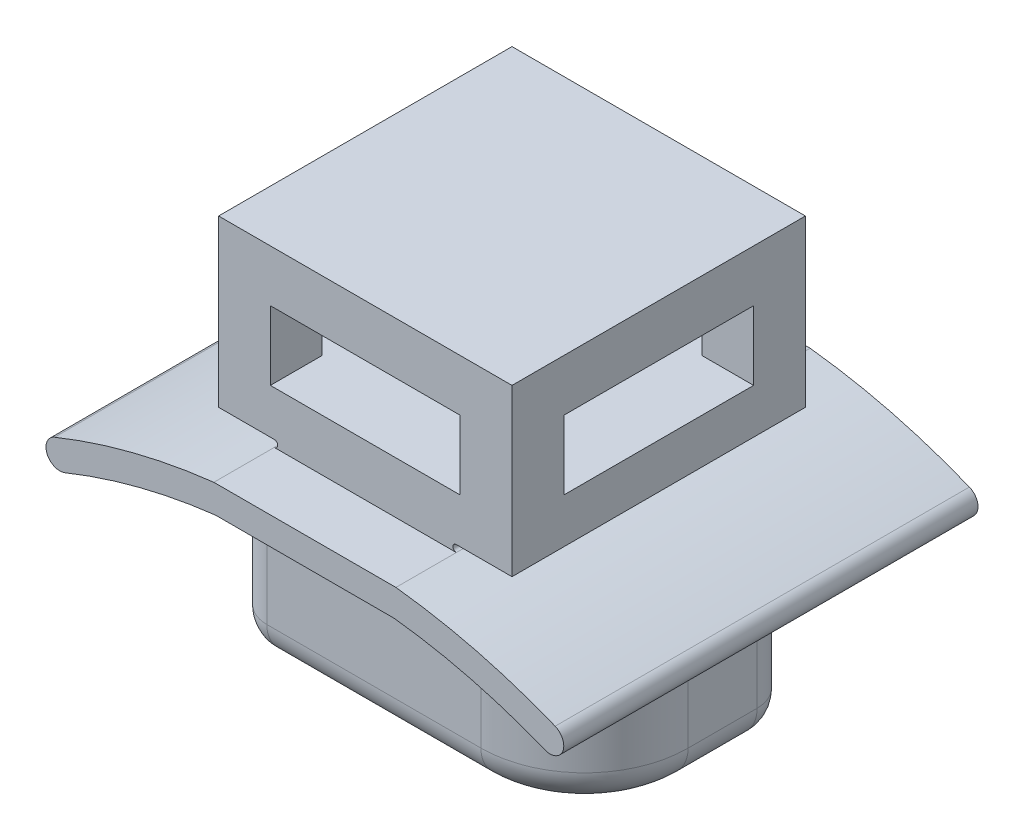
ISO-10303-21;
HEADER;
FILE_DESCRIPTION(('STEP AP214'),'2;1');
FILE_NAME('part.step','',(''),(''),'','','');
FILE_SCHEMA(('AUTOMOTIVE_DESIGN { 1 0 10303 214 1 1 1 1 }'));
ENDSEC;
DATA;
#1=APPLICATION_CONTEXT('core data for automotive mechanical design processes');
#2=APPLICATION_PROTOCOL_DEFINITION('international standard','automotive_design',2000,#1);
#3=PRODUCT_CONTEXT('',#1,'mechanical');
#4=PRODUCT('Part','Part','',(#3));
#5=PRODUCT_RELATED_PRODUCT_CATEGORY('part','',(#4));
#6=PRODUCT_DEFINITION_FORMATION('','',#4);
#7=PRODUCT_DEFINITION_CONTEXT('part definition',#1,'design');
#8=PRODUCT_DEFINITION('design','',#6,#7);
#9=PRODUCT_DEFINITION_SHAPE('','',#8);
#10=(LENGTH_UNIT() NAMED_UNIT(*) SI_UNIT(.MILLI.,.METRE.));
#11=(NAMED_UNIT(*) PLANE_ANGLE_UNIT() SI_UNIT($,.RADIAN.));
#12=(NAMED_UNIT(*) SI_UNIT($,.STERADIAN.) SOLID_ANGLE_UNIT());
#13=UNCERTAINTY_MEASURE_WITH_UNIT(LENGTH_MEASURE(1.E-05),#10,'distance_accuracy_value','');
#14=(GEOMETRIC_REPRESENTATION_CONTEXT(3) GLOBAL_UNCERTAINTY_ASSIGNED_CONTEXT((#13)) GLOBAL_UNIT_ASSIGNED_CONTEXT((#10,
#11,#12)) REPRESENTATION_CONTEXT('',''));
#15=CARTESIAN_POINT('',(0.,0.,0.));
#16=DIRECTION('',(0.,0.,1.));
#17=DIRECTION('',(1.,0.,0.));
#18=AXIS2_PLACEMENT_3D('',#15,#16,#17);
#19=CARTESIAN_POINT('',(-4.10128546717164,-10.8,3.));
#20=DIRECTION('',(0.,0.,-1.));
#21=DIRECTION('',(-1.,0.,0.));
#22=AXIS2_PLACEMENT_3D('',#19,#20,#21);
#23=CYLINDRICAL_SURFACE('',#22,1.);
#24=DIRECTION('',(0.,0.,-1.));
#25=VECTOR('',#24,1.);
#26=CARTESIAN_POINT('',(-5.10128546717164,-10.8,3.));
#27=LINE('',#26,#25);
#28=CARTESIAN_POINT('',(-5.10128546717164,-10.8,2.));
#29=VERTEX_POINT('',#28);
#30=CARTESIAN_POINT('',(-5.10128546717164,-10.8,0.));
#31=VERTEX_POINT('',#30);
#32=EDGE_CURVE('E228',#29,#31,#27,.T.);
#33=ORIENTED_EDGE('',*,*,#32,.T.);
#34=CARTESIAN_POINT('',(-4.10128546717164,-10.8,0.));
#35=DIRECTION('',(0.,0.,-1.));
#36=DIRECTION('',(-1.,0.,0.));
#37=AXIS2_PLACEMENT_3D('',#34,#35,#36);
#38=CIRCLE('',#37,1.);
#39=CARTESIAN_POINT('',(-4.10128546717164,-11.8,0.));
#40=VERTEX_POINT('',#39);
#41=EDGE_CURVE('E319',#31,#40,#38,.F.);
#42=ORIENTED_EDGE('',*,*,#41,.T.);
#43=DIRECTION('',(0.,0.,-1.));
#44=VECTOR('',#43,1.);
#45=CARTESIAN_POINT('',(-4.10128546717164,-11.8,3.));
#46=LINE('',#45,#44);
#47=CARTESIAN_POINT('',(-4.10128546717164,-11.8,2.));
#48=VERTEX_POINT('',#47);
#49=EDGE_CURVE('E274',#48,#40,#46,.T.);
#50=ORIENTED_EDGE('',*,*,#49,.F.);
#51=CARTESIAN_POINT('',(-4.10128546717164,-10.8,2.));
#52=DIRECTION('',(0.,0.,-1.));
#53=DIRECTION('',(-1.,0.,0.));
#54=AXIS2_PLACEMENT_3D('',#51,#52,#53);
#55=CIRCLE('',#54,1.);
#56=EDGE_CURVE('E317',#48,#29,#55,.T.);
#57=ORIENTED_EDGE('',*,*,#56,.T.);
#58=EDGE_LOOP('',(#33,#42,#50,#57));
#59=FACE_BOUND('',#58,.T.);
#60=ADVANCED_FACE('F47',(#59),#23,.T.);
#61=CARTESIAN_POINT('',(-4.10128546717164,-11.8,3.));
#62=DIRECTION('',(0.,1.,0.));
#63=DIRECTION('',(-1.,0.,0.));
#64=AXIS2_PLACEMENT_3D('',#61,#62,#63);
#65=PLANE('',#64);
#66=ORIENTED_EDGE('',*,*,#49,.T.);
#67=CARTESIAN_POINT('',(-2.10128546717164,-11.8,0.));
#68=DIRECTION('',(0.,1.,0.));
#69=DIRECTION('',(-1.,0.,0.));
#70=AXIS2_PLACEMENT_3D('',#67,#68,#69);
#71=CIRCLE('',#70,2.);
#72=CARTESIAN_POINT('',(-2.10128546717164,-11.8,-2.));
#73=VERTEX_POINT('',#72);
#74=EDGE_CURVE('E328',#40,#73,#71,.F.);
#75=ORIENTED_EDGE('',*,*,#74,.T.);
#76=DIRECTION('',(1.,0.,0.));
#77=VECTOR('',#76,1.);
#78=CARTESIAN_POINT('',(4.101285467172,-11.8,-2.));
#79=LINE('',#78,#77);
#80=CARTESIAN_POINT('',(4.101285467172,-11.8,-2.));
#81=VERTEX_POINT('',#80);
#82=EDGE_CURVE('E326',#73,#81,#79,.T.);
#83=ORIENTED_EDGE('',*,*,#82,.T.);
#84=DIRECTION('',(0.,0.,-1.));
#85=VECTOR('',#84,1.);
#86=CARTESIAN_POINT('',(4.101285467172,-11.8,3.));
#87=LINE('',#86,#85);
#88=CARTESIAN_POINT('',(4.101285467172,-11.8,0.));
#89=VERTEX_POINT('',#88);
#90=EDGE_CURVE('E271',#89,#81,#87,.T.);
#91=ORIENTED_EDGE('',*,*,#90,.F.);
#92=CARTESIAN_POINT('',(2.101285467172,-11.8,0.));
#93=DIRECTION('',(0.,1.,0.));
#94=DIRECTION('',(-1.,0.,0.));
#95=AXIS2_PLACEMENT_3D('',#92,#93,#94);
#96=CIRCLE('',#95,2.);
#97=CARTESIAN_POINT('',(2.101285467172,-11.8,2.));
#98=VERTEX_POINT('',#97);
#99=EDGE_CURVE('E324',#89,#98,#96,.F.);
#100=ORIENTED_EDGE('',*,*,#99,.T.);
#101=DIRECTION('',(1.,0.,0.));
#102=VECTOR('',#101,1.);
#103=CARTESIAN_POINT('',(-4.10128546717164,-11.8,2.));
#104=LINE('',#103,#102);
#105=EDGE_CURVE('E322',#98,#48,#104,.F.);
#106=ORIENTED_EDGE('',*,*,#105,.T.);
#107=EDGE_LOOP('',(#66,#75,#83,#91,#100,#106));
#108=FACE_BOUND('',#107,.T.);
#109=ADVANCED_FACE('F455',(#108),#65,.F.);
#110=CARTESIAN_POINT('',(4.101285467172,-10.8,3.));
#111=DIRECTION('',(0.,0.,-1.));
#112=DIRECTION('',(-1.,0.,0.));
#113=AXIS2_PLACEMENT_3D('',#110,#111,#112);
#114=CYLINDRICAL_SURFACE('',#113,1.);
#115=ORIENTED_EDGE('',*,*,#90,.T.);
#116=CARTESIAN_POINT('',(4.101285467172,-10.8,-2.));
#117=DIRECTION('',(0.,0.,-1.));
#118=DIRECTION('',(-1.,0.,0.));
#119=AXIS2_PLACEMENT_3D('',#116,#117,#118);
#120=CIRCLE('',#119,1.);
#121=CARTESIAN_POINT('',(5.101285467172,-10.8,-2.));
#122=VERTEX_POINT('',#121);
#123=EDGE_CURVE('E342',#81,#122,#120,.F.);
#124=ORIENTED_EDGE('',*,*,#123,.T.);
#125=DIRECTION('',(0.,0.,-1.));
#126=VECTOR('',#125,1.);
#127=CARTESIAN_POINT('',(5.101285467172,-10.8,3.));
#128=LINE('',#127,#126);
#129=CARTESIAN_POINT('',(5.101285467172,-10.8,0.));
#130=VERTEX_POINT('',#129);
#131=EDGE_CURVE('E268',#130,#122,#128,.T.);
#132=ORIENTED_EDGE('',*,*,#131,.F.);
#133=CARTESIAN_POINT('',(4.101285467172,-10.8,0.));
#134=DIRECTION('',(0.,0.,-1.));
#135=DIRECTION('',(-1.,0.,0.));
#136=AXIS2_PLACEMENT_3D('',#133,#134,#135);
#137=CIRCLE('',#136,1.);
#138=EDGE_CURVE('E340',#130,#89,#137,.T.);
#139=ORIENTED_EDGE('',*,*,#138,.T.);
#140=EDGE_LOOP('',(#115,#124,#132,#139));
#141=FACE_BOUND('',#140,.T.);
#142=ADVANCED_FACE('F384',(#141),#114,.T.);
#143=CARTESIAN_POINT('',(5.101285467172,-8.80000000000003,3.));
#144=DIRECTION('',(-1.,0.,0.));
#145=DIRECTION('',(0.,-1.,0.));
#146=AXIS2_PLACEMENT_3D('',#143,#144,#145);
#147=PLANE('',#146);
#148=ORIENTED_EDGE('',*,*,#131,.T.);
#149=DIRECTION('',(0.,1.,0.));
#150=VECTOR('',#149,1.);
#151=CARTESIAN_POINT('',(5.101285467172,-8.80000000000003,-2.));
#152=LINE('',#151,#150);
#153=CARTESIAN_POINT('',(5.101285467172,-8.80000000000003,-2.));
#154=VERTEX_POINT('',#153);
#155=EDGE_CURVE('E332',#122,#154,#152,.T.);
#156=ORIENTED_EDGE('',*,*,#155,.T.);
#157=DIRECTION('',(0.,0.,-1.));
#158=VECTOR('',#157,1.);
#159=CARTESIAN_POINT('',(5.101285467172,-8.80000000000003,3.));
#160=LINE('',#159,#158);
#161=CARTESIAN_POINT('',(5.101285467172,-8.80000000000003,0.));
#162=VERTEX_POINT('',#161);
#163=EDGE_CURVE('E265',#162,#154,#160,.T.);
#164=ORIENTED_EDGE('',*,*,#163,.F.);
#165=DIRECTION('',(0.,1.,0.));
#166=VECTOR('',#165,1.);
#167=CARTESIAN_POINT('',(5.101285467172,-8.80000000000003,0.));
#168=LINE('',#167,#166);
#169=EDGE_CURVE('E306',#162,#130,#168,.F.);
#170=ORIENTED_EDGE('',*,*,#169,.T.);
#171=EDGE_LOOP('',(#148,#156,#164,#170));
#172=FACE_BOUND('',#171,.T.);
#173=ADVANCED_FACE('F381',(#172),#147,.F.);
#174=CARTESIAN_POINT('',(5.101285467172,-8.80000000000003,3.));
#175=DIRECTION('',(0.,-1.,0.));
#176=DIRECTION('',(0.,0.,-1.));
#177=AXIS2_PLACEMENT_3D('',#174,#175,#176);
#178=PLANE('',#177);
#179=ORIENTED_EDGE('',*,*,#163,.T.);
#180=CARTESIAN_POINT('',(4.101285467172,-8.80000000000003,-2.));
#181=DIRECTION('',(0.,-1.,0.));
#182=DIRECTION('',(0.,0.,-1.));
#183=AXIS2_PLACEMENT_3D('',#180,#181,#182);
#184=CIRCLE('',#183,1.);
#185=CARTESIAN_POINT('',(4.101285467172,-8.80000000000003,-3.));
#186=VERTEX_POINT('',#185);
#187=EDGE_CURVE('E334',#154,#186,#184,.F.);
#188=ORIENTED_EDGE('',*,*,#187,.T.);
#189=DIRECTION('',(-1.,0.,0.));
#190=VECTOR('',#189,1.);
#191=CARTESIAN_POINT('',(5.101285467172,-8.80000000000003,-3.));
#192=LINE('',#191,#190);
#193=CARTESIAN_POINT('',(3.00000000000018,-8.80000000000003,-3.));
#194=VERTEX_POINT('',#193);
#195=EDGE_CURVE('E229',#186,#194,#192,.T.);
#196=ORIENTED_EDGE('',*,*,#195,.T.);
#197=DIRECTION('',(0.,0.,-1.));
#198=VECTOR('',#197,1.);
#199=CARTESIAN_POINT('',(3.00000000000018,-8.80000000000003,3.));
#200=LINE('',#199,#198);
#201=CARTESIAN_POINT('',(3.00000000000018,-8.80000000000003,0.));
#202=VERTEX_POINT('',#201);
#203=EDGE_CURVE('E262',#202,#194,#200,.T.);
#204=ORIENTED_EDGE('',*,*,#203,.F.);
#205=CARTESIAN_POINT('',(1.80844922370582E-13,-8.80000000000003,0.));
#206=DIRECTION('',(0.,-1.,0.));
#207=DIRECTION('',(0.,0.,-1.));
#208=AXIS2_PLACEMENT_3D('',#205,#206,#207);
#209=CIRCLE('',#208,3.);
#210=CARTESIAN_POINT('',(1.80411241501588E-13,-8.80000000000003,3.));
#211=VERTEX_POINT('',#210);
#212=EDGE_CURVE('E296',#202,#211,#209,.T.);
#213=ORIENTED_EDGE('',*,*,#212,.T.);
#214=DIRECTION('',(-1.,0.,0.));
#215=VECTOR('',#214,1.);
#216=CARTESIAN_POINT('',(5.101285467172,-8.80000000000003,3.));
#217=LINE('',#216,#215);
#218=CARTESIAN_POINT('',(2.101285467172,-8.80000000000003,3.));
#219=VERTEX_POINT('',#218);
#220=EDGE_CURVE('E203',#219,#211,#217,.T.);
#221=ORIENTED_EDGE('',*,*,#220,.F.);
#222=CARTESIAN_POINT('',(2.101285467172,-8.80000000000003,0.));
#223=DIRECTION('',(0.,-1.,0.));
#224=DIRECTION('',(0.,0.,-1.));
#225=AXIS2_PLACEMENT_3D('',#222,#223,#224);
#226=CIRCLE('',#225,3.);
#227=EDGE_CURVE('E304',#219,#162,#226,.F.);
#228=ORIENTED_EDGE('',*,*,#227,.T.);
#229=EDGE_LOOP('',(#179,#188,#196,#204,#213,#221,#228));
#230=FACE_BOUND('',#229,.T.);
#231=ADVANCED_FACE('F428',(#230),#178,.F.);
#232=CARTESIAN_POINT('',(3.00000000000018,-8.80000000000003,3.));
#233=DIRECTION('',(-1.,0.,0.));
#234=DIRECTION('',(0.,-1.,0.));
#235=AXIS2_PLACEMENT_3D('',#232,#233,#234);
#236=PLANE('',#235);
#237=DIRECTION('',(0.,0.,-1.));
#238=VECTOR('',#237,1.);
#239=CARTESIAN_POINT('',(3.00000000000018,-6.80000000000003,3.));
#240=LINE('',#239,#238);
#241=CARTESIAN_POINT('',(3.00000000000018,-6.80000000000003,0.));
#242=VERTEX_POINT('',#241);
#243=CARTESIAN_POINT('',(3.00000000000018,-6.80000000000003,-3.));
#244=VERTEX_POINT('',#243);
#245=EDGE_CURVE('E260',#242,#244,#240,.T.);
#246=ORIENTED_EDGE('',*,*,#245,.F.);
#247=DIRECTION('',(0.,1.,0.));
#248=VECTOR('',#247,1.);
#249=CARTESIAN_POINT('',(3.00000000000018,-8.80000000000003,0.));
#250=LINE('',#249,#248);
#251=EDGE_CURVE('E285',#242,#202,#250,.F.);
#252=ORIENTED_EDGE('',*,*,#251,.T.);
#253=ORIENTED_EDGE('',*,*,#203,.T.);
#254=DIRECTION('',(0.,1.,0.));
#255=VECTOR('',#254,1.);
#256=CARTESIAN_POINT('',(3.00000000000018,-8.80000000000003,-3.));
#257=LINE('',#256,#255);
#258=EDGE_CURVE('E231',#194,#244,#257,.T.);
#259=ORIENTED_EDGE('',*,*,#258,.T.);
#260=EDGE_LOOP('',(#246,#252,#253,#259));
#261=FACE_BOUND('',#260,.T.);
#262=ADVANCED_FACE('F445',(#261),#236,.F.);
#263=CARTESIAN_POINT('',(3.00000000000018,-6.80000000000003,3.));
#264=DIRECTION('',(0.,-1.,0.));
#265=DIRECTION('',(0.,0.,-1.));
#266=AXIS2_PLACEMENT_3D('',#263,#264,#265);
#267=PLANE('',#266);
#268=DIRECTION('',(0.,0.,-1.));
#269=VECTOR('',#268,1.);
#270=CARTESIAN_POINT('',(2.50000000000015,-6.80000000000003,3.));
#271=LINE('',#270,#269);
#272=CARTESIAN_POINT('',(2.50000000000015,-6.80000000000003,1.65831239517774));
#273=VERTEX_POINT('',#272);
#274=CARTESIAN_POINT('',(2.50000000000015,-6.80000000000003,-3.));
#275=VERTEX_POINT('',#274);
#276=EDGE_CURVE('E258',#273,#275,#271,.T.);
#277=ORIENTED_EDGE('',*,*,#276,.F.);
#278=CARTESIAN_POINT('',(1.80411241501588E-13,-6.80000000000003,0.));
#279=DIRECTION('',(0.,-1.,0.));
#280=DIRECTION('',(0.,0.,-1.));
#281=AXIS2_PLACEMENT_3D('',#278,#279,#280);
#282=CIRCLE('',#281,3.);
#283=EDGE_CURVE('E283',#273,#242,#282,.F.);
#284=ORIENTED_EDGE('',*,*,#283,.T.);
#285=ORIENTED_EDGE('',*,*,#245,.T.);
#286=DIRECTION('',(-1.,0.,0.));
#287=VECTOR('',#286,1.);
#288=CARTESIAN_POINT('',(3.00000000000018,-6.80000000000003,-3.));
#289=LINE('',#288,#287);
#290=EDGE_CURVE('E235',#244,#275,#289,.T.);
#291=ORIENTED_EDGE('',*,*,#290,.T.);
#292=EDGE_LOOP('',(#277,#284,#285,#291));
#293=FACE_BOUND('',#292,.T.);
#294=ADVANCED_FACE('F442',(#293),#267,.F.);
#295=CARTESIAN_POINT('',(2.50000000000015,-6.80000000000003,3.));
#296=DIRECTION('',(-1.,0.,0.));
#297=DIRECTION('',(0.,0.,1.));
#298=AXIS2_PLACEMENT_3D('',#295,#296,#297);
#299=PLANE('',#298);
#300=DIRECTION('',(0.,0.,-1.));
#301=VECTOR('',#300,1.);
#302=CARTESIAN_POINT('',(2.50000000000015,-5.8000000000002,3.));
#303=LINE('',#302,#301);
#304=CARTESIAN_POINT('',(2.50000000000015,-5.8000000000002,1.65831239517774));
#305=VERTEX_POINT('',#304);
#306=CARTESIAN_POINT('',(2.50000000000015,-5.8000000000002,-3.));
#307=VERTEX_POINT('',#306);
#308=EDGE_CURVE('E213',#305,#307,#303,.T.);
#309=ORIENTED_EDGE('',*,*,#308,.F.);
#310=DIRECTION('',(0.,1.,0.));
#311=VECTOR('',#310,1.);
#312=CARTESIAN_POINT('',(2.50000000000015,-5.8000000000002,1.65831239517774));
#313=LINE('',#312,#311);
#314=EDGE_CURVE('E281',#305,#273,#313,.F.);
#315=ORIENTED_EDGE('',*,*,#314,.T.);
#316=ORIENTED_EDGE('',*,*,#276,.T.);
#317=DIRECTION('',(0.,1.,0.));
#318=VECTOR('',#317,1.);
#319=CARTESIAN_POINT('',(2.50000000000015,-6.80000000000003,-3.));
#320=LINE('',#319,#318);
#321=EDGE_CURVE('E238',#275,#307,#320,.T.);
#322=ORIENTED_EDGE('',*,*,#321,.T.);
#323=EDGE_LOOP('',(#309,#315,#316,#322));
#324=FACE_BOUND('',#323,.T.);
#325=ADVANCED_FACE('F437',(#324),#299,.F.);
#326=CARTESIAN_POINT('',(-2.49999999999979,-5.8000000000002,3.));
#327=DIRECTION('',(0.,-1.,0.));
#328=DIRECTION('',(1.,0.,0.));
#329=AXIS2_PLACEMENT_3D('',#326,#327,#328);
#330=PLANE('',#329);
#331=DIRECTION('',(-1.,0.,0.));
#332=VECTOR('',#331,1.);
#333=CARTESIAN_POINT('',(-2.49999999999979,-5.8000000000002,3.));
#334=LINE('',#333,#332);
#335=CARTESIAN_POINT('',(1.80411241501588E-13,-5.8000000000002,3.));
#336=VERTEX_POINT('',#335);
#337=CARTESIAN_POINT('',(-2.49999999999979,-5.8000000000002,3.));
#338=VERTEX_POINT('',#337);
#339=EDGE_CURVE('E193',#336,#338,#334,.T.);
#340=ORIENTED_EDGE('',*,*,#339,.F.);
#341=CARTESIAN_POINT('',(1.80194401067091E-13,-5.8000000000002,0.));
#342=DIRECTION('',(0.,-1.,0.));
#343=DIRECTION('',(1.,0.,0.));
#344=AXIS2_PLACEMENT_3D('',#341,#342,#343);
#345=CIRCLE('',#344,3.);
#346=EDGE_CURVE('E279',#336,#305,#345,.F.);
#347=ORIENTED_EDGE('',*,*,#346,.T.);
#348=ORIENTED_EDGE('',*,*,#308,.T.);
#349=DIRECTION('',(-1.,0.,0.));
#350=VECTOR('',#349,1.);
#351=CARTESIAN_POINT('',(-2.49999999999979,-5.8000000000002,-3.));
#352=LINE('',#351,#350);
#353=CARTESIAN_POINT('',(1.80411241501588E-13,-5.8000000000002,-3.));
#354=VERTEX_POINT('',#353);
#355=EDGE_CURVE('E241',#307,#354,#352,.T.);
#356=ORIENTED_EDGE('',*,*,#355,.T.);
#357=CARTESIAN_POINT('',(1.80411241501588E-13,-5.8000000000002,0.));
#358=DIRECTION('',(0.,-1.,0.));
#359=DIRECTION('',(1.,0.,0.));
#360=AXIS2_PLACEMENT_3D('',#357,#358,#359);
#361=CIRCLE('',#360,3.);
#362=CARTESIAN_POINT('',(-2.49999999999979,-5.8000000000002,-1.65831239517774));
#363=VERTEX_POINT('',#362);
#364=EDGE_CURVE('E210',#354,#363,#361,.F.);
#365=ORIENTED_EDGE('',*,*,#364,.T.);
#366=DIRECTION('',(0.,0.,-1.));
#367=VECTOR('',#366,1.);
#368=CARTESIAN_POINT('',(-2.49999999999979,-5.8000000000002,3.));
#369=LINE('',#368,#367);
#370=EDGE_CURVE('E206',#338,#363,#369,.T.);
#371=ORIENTED_EDGE('',*,*,#370,.F.);
#372=EDGE_LOOP('',(#340,#347,#348,#356,#365,#371));
#373=FACE_BOUND('',#372,.T.);
#374=ADVANCED_FACE('F207',(#373),#330,.F.);
#375=CARTESIAN_POINT('',(-2.49999999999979,-6.80000000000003,3.));
#376=DIRECTION('',(1.,0.,0.));
#377=DIRECTION('',(0.,0.,-1.));
#378=AXIS2_PLACEMENT_3D('',#375,#376,#377);
#379=PLANE('',#378);
#380=ORIENTED_EDGE('',*,*,#370,.T.);
#381=DIRECTION('',(0.,1.,0.));
#382=VECTOR('',#381,1.);
#383=CARTESIAN_POINT('',(-2.49999999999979,-5.8000000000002,-1.65831239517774));
#384=LINE('',#383,#382);
#385=CARTESIAN_POINT('',(-2.49999999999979,-6.80000000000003,-1.65831239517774));
#386=VERTEX_POINT('',#385);
#387=EDGE_CURVE('E292',#363,#386,#384,.F.);
#388=ORIENTED_EDGE('',*,*,#387,.T.);
#389=DIRECTION('',(0.,0.,-1.));
#390=VECTOR('',#389,1.);
#391=CARTESIAN_POINT('',(-2.49999999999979,-6.80000000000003,3.));
#392=LINE('',#391,#390);
#393=CARTESIAN_POINT('',(-2.49999999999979,-6.80000000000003,3.));
#394=VERTEX_POINT('',#393);
#395=EDGE_CURVE('E214',#394,#386,#392,.T.);
#396=ORIENTED_EDGE('',*,*,#395,.F.);
#397=DIRECTION('',(0.,-1.,0.));
#398=VECTOR('',#397,1.);
#399=CARTESIAN_POINT('',(-2.49999999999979,-6.80000000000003,3.));
#400=LINE('',#399,#398);
#401=EDGE_CURVE('E198',#338,#394,#400,.T.);
#402=ORIENTED_EDGE('',*,*,#401,.F.);
#403=EDGE_LOOP('',(#380,#388,#396,#402));
#404=FACE_BOUND('',#403,.T.);
#405=ADVANCED_FACE('F216',(#404),#379,.F.);
#406=CARTESIAN_POINT('',(-2.49999999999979,-6.80000000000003,3.));
#407=DIRECTION('',(0.,-1.,0.));
#408=DIRECTION('',(0.,0.,-1.));
#409=AXIS2_PLACEMENT_3D('',#406,#407,#408);
#410=PLANE('',#409);
#411=ORIENTED_EDGE('',*,*,#395,.T.);
#412=CARTESIAN_POINT('',(1.80411241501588E-13,-6.80000000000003,0.));
#413=DIRECTION('',(0.,-1.,0.));
#414=DIRECTION('',(0.,0.,-1.));
#415=AXIS2_PLACEMENT_3D('',#412,#413,#414);
#416=CIRCLE('',#415,3.);
#417=CARTESIAN_POINT('',(-2.99999999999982,-6.80000000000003,0.));
#418=VERTEX_POINT('',#417);
#419=EDGE_CURVE('E294',#386,#418,#416,.F.);
#420=ORIENTED_EDGE('',*,*,#419,.T.);
#421=DIRECTION('',(0.,0.,-1.));
#422=VECTOR('',#421,1.);
#423=CARTESIAN_POINT('',(-2.99999999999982,-6.80000000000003,3.));
#424=LINE('',#423,#422);
#425=CARTESIAN_POINT('',(-2.99999999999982,-6.80000000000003,3.));
#426=VERTEX_POINT('',#425);
#427=EDGE_CURVE('E253',#426,#418,#424,.T.);
#428=ORIENTED_EDGE('',*,*,#427,.F.);
#429=DIRECTION('',(-1.,0.,0.));
#430=VECTOR('',#429,1.);
#431=CARTESIAN_POINT('',(-2.49999999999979,-6.80000000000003,3.));
#432=LINE('',#431,#430);
#433=EDGE_CURVE('E219',#394,#426,#432,.T.);
#434=ORIENTED_EDGE('',*,*,#433,.F.);
#435=EDGE_LOOP('',(#411,#420,#428,#434));
#436=FACE_BOUND('',#435,.T.);
#437=ADVANCED_FACE('F418',(#436),#410,.F.);
#438=CARTESIAN_POINT('',(-2.99999999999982,-8.79999999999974,3.));
#439=DIRECTION('',(1.,0.,0.));
#440=DIRECTION('',(0.,0.,-1.));
#441=AXIS2_PLACEMENT_3D('',#438,#439,#440);
#442=PLANE('',#441);
#443=ORIENTED_EDGE('',*,*,#427,.T.);
#444=DIRECTION('',(0.,-1.,0.));
#445=VECTOR('',#444,1.);
#446=CARTESIAN_POINT('',(-2.99999999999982,-8.79999999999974,0.));
#447=LINE('',#446,#445);
#448=CARTESIAN_POINT('',(-2.99999999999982,-8.79999999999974,0.));
#449=VERTEX_POINT('',#448);
#450=EDGE_CURVE('E287',#418,#449,#447,.T.);
#451=ORIENTED_EDGE('',*,*,#450,.T.);
#452=DIRECTION('',(0.,0.,-1.));
#453=VECTOR('',#452,1.);
#454=CARTESIAN_POINT('',(-2.99999999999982,-8.79999999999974,3.));
#455=LINE('',#454,#453);
#456=CARTESIAN_POINT('',(-2.99999999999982,-8.79999999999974,3.));
#457=VERTEX_POINT('',#456);
#458=EDGE_CURVE('E250',#457,#449,#455,.T.);
#459=ORIENTED_EDGE('',*,*,#458,.F.);
#460=DIRECTION('',(0.,-1.,0.));
#461=VECTOR('',#460,1.);
#462=CARTESIAN_POINT('',(-2.99999999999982,-8.79999999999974,3.));
#463=LINE('',#462,#461);
#464=EDGE_CURVE('E221',#426,#457,#463,.T.);
#465=ORIENTED_EDGE('',*,*,#464,.F.);
#466=EDGE_LOOP('',(#443,#451,#459,#465));
#467=FACE_BOUND('',#466,.T.);
#468=ADVANCED_FACE('F424',(#467),#442,.F.);
#469=CARTESIAN_POINT('',(-2.99999999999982,-8.79999999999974,3.));
#470=DIRECTION('',(0.,-1.,0.));
#471=DIRECTION('',(1.,0.,0.));
#472=AXIS2_PLACEMENT_3D('',#469,#470,#471);
#473=PLANE('',#472);
#474=DIRECTION('',(0.,0.,-1.));
#475=VECTOR('',#474,1.);
#476=CARTESIAN_POINT('',(-5.10128546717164,-8.79999999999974,3.));
#477=LINE('',#476,#475);
#478=CARTESIAN_POINT('',(-5.10128546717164,-8.79999999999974,2.));
#479=VERTEX_POINT('',#478);
#480=CARTESIAN_POINT('',(-5.10128546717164,-8.79999999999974,0.));
#481=VERTEX_POINT('',#480);
#482=EDGE_CURVE('E248',#479,#481,#477,.T.);
#483=ORIENTED_EDGE('',*,*,#482,.F.);
#484=CARTESIAN_POINT('',(-4.10128546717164,-8.79999999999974,2.));
#485=DIRECTION('',(0.,-1.,0.));
#486=DIRECTION('',(1.,0.,0.));
#487=AXIS2_PLACEMENT_3D('',#484,#485,#486);
#488=CIRCLE('',#487,1.);
#489=CARTESIAN_POINT('',(-4.10128546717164,-8.79999999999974,3.));
#490=VERTEX_POINT('',#489);
#491=EDGE_CURVE('E56',#479,#490,#488,.F.);
#492=ORIENTED_EDGE('',*,*,#491,.T.);
#493=DIRECTION('',(-1.,0.,0.));
#494=VECTOR('',#493,1.);
#495=CARTESIAN_POINT('',(-2.99999999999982,-8.79999999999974,3.));
#496=LINE('',#495,#494);
#497=EDGE_CURVE('E226',#457,#490,#496,.T.);
#498=ORIENTED_EDGE('',*,*,#497,.F.);
#499=ORIENTED_EDGE('',*,*,#458,.T.);
#500=CARTESIAN_POINT('',(1.80411241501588E-13,-8.79999999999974,0.));
#501=DIRECTION('',(0.,-1.,0.));
#502=DIRECTION('',(1.,0.,0.));
#503=AXIS2_PLACEMENT_3D('',#500,#501,#502);
#504=CIRCLE('',#503,3.);
#505=CARTESIAN_POINT('',(1.80411241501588E-13,-8.79999999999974,-3.));
#506=VERTEX_POINT('',#505);
#507=EDGE_CURVE('E299',#449,#506,#504,.T.);
#508=ORIENTED_EDGE('',*,*,#507,.T.);
#509=DIRECTION('',(-1.,0.,0.));
#510=VECTOR('',#509,1.);
#511=CARTESIAN_POINT('',(-2.99999999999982,-8.79999999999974,-3.));
#512=LINE('',#511,#510);
#513=CARTESIAN_POINT('',(-2.10128546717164,-8.79999999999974,-3.));
#514=VERTEX_POINT('',#513);
#515=EDGE_CURVE('E243',#506,#514,#512,.T.);
#516=ORIENTED_EDGE('',*,*,#515,.T.);
#517=CARTESIAN_POINT('',(-2.10128546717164,-8.79999999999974,0.));
#518=DIRECTION('',(0.,-1.,0.));
#519=DIRECTION('',(1.,0.,0.));
#520=AXIS2_PLACEMENT_3D('',#517,#518,#519);
#521=CIRCLE('',#520,3.);
#522=EDGE_CURVE('E314',#514,#481,#521,.F.);
#523=ORIENTED_EDGE('',*,*,#522,.T.);
#524=EDGE_LOOP('',(#483,#492,#498,#499,#508,#516,#523));
#525=FACE_BOUND('',#524,.T.);
#526=ADVANCED_FACE('F407',(#525),#473,.F.);
#527=CARTESIAN_POINT('',(-5.10128546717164,-8.79999999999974,3.));
#528=DIRECTION('',(1.,0.,0.));
#529=DIRECTION('',(0.,1.,0.));
#530=AXIS2_PLACEMENT_3D('',#527,#528,#529);
#531=PLANE('',#530);
#532=ORIENTED_EDGE('',*,*,#32,.F.);
#533=DIRECTION('',(0.,-1.,0.));
#534=VECTOR('',#533,1.);
#535=CARTESIAN_POINT('',(-5.10128546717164,-8.79999999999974,2.));
#536=LINE('',#535,#534);
#537=EDGE_CURVE('E64',#29,#479,#536,.F.);
#538=ORIENTED_EDGE('',*,*,#537,.T.);
#539=ORIENTED_EDGE('',*,*,#482,.T.);
#540=DIRECTION('',(0.,-1.,0.));
#541=VECTOR('',#540,1.);
#542=CARTESIAN_POINT('',(-5.10128546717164,-10.8,0.));
#543=LINE('',#542,#541);
#544=EDGE_CURVE('E309',#481,#31,#543,.T.);
#545=ORIENTED_EDGE('',*,*,#544,.T.);
#546=EDGE_LOOP('',(#532,#538,#539,#545));
#547=FACE_BOUND('',#546,.T.);
#548=ADVANCED_FACE('F540',(#547),#531,.F.);
#549=CARTESIAN_POINT('',(-4.10128546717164,-10.8,3.));
#550=DIRECTION('',(0.,0.,-1.));
#551=DIRECTION('',(-1.,0.,0.));
#552=AXIS2_PLACEMENT_3D('',#549,#550,#551);
#553=PLANE('',#552);
#554=ORIENTED_EDGE('',*,*,#497,.T.);
#555=DIRECTION('',(0.,-1.,0.));
#556=VECTOR('',#555,1.);
#557=CARTESIAN_POINT('',(-4.10128546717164,-10.8,3.));
#558=LINE('',#557,#556);
#559=CARTESIAN_POINT('',(-4.10128546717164,-10.8,3.));
#560=VERTEX_POINT('',#559);
#561=EDGE_CURVE('E346',#490,#560,#558,.T.);
#562=ORIENTED_EDGE('',*,*,#561,.T.);
#563=DIRECTION('',(1.,0.,0.));
#564=VECTOR('',#563,1.);
#565=CARTESIAN_POINT('',(-4.10128546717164,-10.8,3.));
#566=LINE('',#565,#564);
#567=CARTESIAN_POINT('',(2.101285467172,-10.8,3.));
#568=VERTEX_POINT('',#567);
#569=EDGE_CURVE('E344',#560,#568,#566,.T.);
#570=ORIENTED_EDGE('',*,*,#569,.T.);
#571=DIRECTION('',(0.,1.,0.));
#572=VECTOR('',#571,1.);
#573=CARTESIAN_POINT('',(2.101285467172,-10.8,3.));
#574=LINE('',#573,#572);
#575=EDGE_CURVE('E302',#568,#219,#574,.T.);
#576=ORIENTED_EDGE('',*,*,#575,.T.);
#577=ORIENTED_EDGE('',*,*,#220,.T.);
#578=DIRECTION('',(0.,1.,0.));
#579=VECTOR('',#578,1.);
#580=CARTESIAN_POINT('',(1.81278603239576E-13,-10.8,3.));
#581=LINE('',#580,#579);
#582=EDGE_CURVE('E201',#211,#336,#581,.T.);
#583=ORIENTED_EDGE('',*,*,#582,.T.);
#584=ORIENTED_EDGE('',*,*,#339,.T.);
#585=ORIENTED_EDGE('',*,*,#401,.T.);
#586=ORIENTED_EDGE('',*,*,#433,.T.);
#587=ORIENTED_EDGE('',*,*,#464,.T.);
#588=EDGE_LOOP('',(#554,#562,#570,#576,#577,#583,#584,#585,#586,#587));
#589=FACE_BOUND('',#588,.T.);
#590=ADVANCED_FACE('F196',(#589),#553,.F.);
#591=CARTESIAN_POINT('',(-4.10128546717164,-10.8,-3.));
#592=DIRECTION('',(0.,0.,-1.));
#593=DIRECTION('',(-1.,0.,0.));
#594=AXIS2_PLACEMENT_3D('',#591,#592,#593);
#595=PLANE('',#594);
#596=ORIENTED_EDGE('',*,*,#195,.F.);
#597=DIRECTION('',(0.,1.,0.));
#598=VECTOR('',#597,1.);
#599=CARTESIAN_POINT('',(4.101285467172,-10.8,-3.));
#600=LINE('',#599,#598);
#601=CARTESIAN_POINT('',(4.101285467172,-10.8,-3.));
#602=VERTEX_POINT('',#601);
#603=EDGE_CURVE('E338',#186,#602,#600,.F.);
#604=ORIENTED_EDGE('',*,*,#603,.T.);
#605=DIRECTION('',(1.,0.,0.));
#606=VECTOR('',#605,1.);
#607=CARTESIAN_POINT('',(-2.10128546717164,-10.8,-3.));
#608=LINE('',#607,#606);
#609=CARTESIAN_POINT('',(-2.10128546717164,-10.8,-3.));
#610=VERTEX_POINT('',#609);
#611=EDGE_CURVE('E336',#602,#610,#608,.F.);
#612=ORIENTED_EDGE('',*,*,#611,.T.);
#613=DIRECTION('',(0.,-1.,0.));
#614=VECTOR('',#613,1.);
#615=CARTESIAN_POINT('',(-2.10128546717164,-8.79999999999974,-3.));
#616=LINE('',#615,#614);
#617=EDGE_CURVE('E312',#610,#514,#616,.F.);
#618=ORIENTED_EDGE('',*,*,#617,.T.);
#619=ORIENTED_EDGE('',*,*,#515,.F.);
#620=DIRECTION('',(0.,-1.,0.));
#621=VECTOR('',#620,1.);
#622=CARTESIAN_POINT('',(1.80411241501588E-13,-6.80000000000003,-3.));
#623=LINE('',#622,#621);
#624=EDGE_CURVE('E290',#506,#354,#623,.F.);
#625=ORIENTED_EDGE('',*,*,#624,.T.);
#626=ORIENTED_EDGE('',*,*,#355,.F.);
#627=ORIENTED_EDGE('',*,*,#321,.F.);
#628=ORIENTED_EDGE('',*,*,#290,.F.);
#629=ORIENTED_EDGE('',*,*,#258,.F.);
#630=EDGE_LOOP('',(#596,#604,#612,#618,#619,#625,#626,#627,#628,#629));
#631=FACE_BOUND('',#630,.T.);
#632=ADVANCED_FACE('F400',(#631),#595,.T.);
#633=CARTESIAN_POINT('',(1.81278603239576E-13,-10.8,0.));
#634=DIRECTION('',(0.,1.,0.));
#635=DIRECTION('',(-1.,0.,0.));
#636=AXIS2_PLACEMENT_3D('',#633,#634,#635);
#637=CYLINDRICAL_SURFACE('',#636,3.);
#638=ORIENTED_EDGE('',*,*,#212,.F.);
#639=ORIENTED_EDGE('',*,*,#251,.F.);
#640=ORIENTED_EDGE('',*,*,#283,.F.);
#641=ORIENTED_EDGE('',*,*,#314,.F.);
#642=ORIENTED_EDGE('',*,*,#346,.F.);
#643=ORIENTED_EDGE('',*,*,#582,.F.);
#644=EDGE_LOOP('',(#638,#639,#640,#641,#642,#643));
#645=FACE_BOUND('',#644,.T.);
#646=ADVANCED_FACE('F433',(#645),#637,.T.);
#647=CARTESIAN_POINT('',(1.80411241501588E-13,-8.79999999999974,0.));
#648=DIRECTION('',(0.,1.,0.));
#649=DIRECTION('',(0.,0.,1.));
#650=AXIS2_PLACEMENT_3D('',#647,#648,#649);
#651=CYLINDRICAL_SURFACE('',#650,3.);
#652=ORIENTED_EDGE('',*,*,#364,.F.);
#653=ORIENTED_EDGE('',*,*,#624,.F.);
#654=ORIENTED_EDGE('',*,*,#507,.F.);
#655=ORIENTED_EDGE('',*,*,#450,.F.);
#656=ORIENTED_EDGE('',*,*,#419,.F.);
#657=ORIENTED_EDGE('',*,*,#387,.F.);
#658=EDGE_LOOP('',(#652,#653,#654,#655,#656,#657));
#659=FACE_BOUND('',#658,.T.);
#660=ADVANCED_FACE('F414',(#659),#651,.T.);
#661=CARTESIAN_POINT('',(2.101285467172,-10.8,0.));
#662=DIRECTION('',(0.,1.,0.));
#663=DIRECTION('',(-1.,0.,0.));
#664=AXIS2_PLACEMENT_3D('',#661,#662,#663);
#665=CYLINDRICAL_SURFACE('',#664,3.);
#666=ORIENTED_EDGE('',*,*,#575,.F.);
#667=CARTESIAN_POINT('',(2.101285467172,-10.8,0.));
#668=DIRECTION('',(0.,1.,0.));
#669=DIRECTION('',(-1.,0.,0.));
#670=AXIS2_PLACEMENT_3D('',#667,#668,#669);
#671=CIRCLE('',#670,3.);
#672=EDGE_CURVE('E12',#568,#130,#671,.T.);
#673=ORIENTED_EDGE('',*,*,#672,.T.);
#674=ORIENTED_EDGE('',*,*,#169,.F.);
#675=ORIENTED_EDGE('',*,*,#227,.F.);
#676=EDGE_LOOP('',(#666,#673,#674,#675));
#677=FACE_BOUND('',#676,.T.);
#678=ADVANCED_FACE('F376',(#677),#665,.T.);
#679=CARTESIAN_POINT('',(-2.10128546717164,-8.79999999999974,0.));
#680=DIRECTION('',(0.,1.,0.));
#681=DIRECTION('',(-1.,0.,0.));
#682=AXIS2_PLACEMENT_3D('',#679,#680,#681);
#683=CYLINDRICAL_SURFACE('',#682,3.);
#684=ORIENTED_EDGE('',*,*,#617,.F.);
#685=CARTESIAN_POINT('',(-2.10128546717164,-10.8,0.));
#686=DIRECTION('',(0.,1.,0.));
#687=DIRECTION('',(-1.,0.,0.));
#688=AXIS2_PLACEMENT_3D('',#685,#686,#687);
#689=CIRCLE('',#688,3.);
#690=EDGE_CURVE('E330',#610,#31,#689,.T.);
#691=ORIENTED_EDGE('',*,*,#690,.T.);
#692=ORIENTED_EDGE('',*,*,#544,.F.);
#693=ORIENTED_EDGE('',*,*,#522,.F.);
#694=EDGE_LOOP('',(#684,#691,#692,#693));
#695=FACE_BOUND('',#694,.T.);
#696=ADVANCED_FACE('F404',(#695),#683,.T.);
#697=CARTESIAN_POINT('',(4.101285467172,-8.80000000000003,-2.));
#698=DIRECTION('',(0.,-1.,0.));
#699=DIRECTION('',(1.,0.,0.));
#700=AXIS2_PLACEMENT_3D('',#697,#698,#699);
#701=CYLINDRICAL_SURFACE('',#700,1.);
#702=ORIENTED_EDGE('',*,*,#187,.F.);
#703=ORIENTED_EDGE('',*,*,#155,.F.);
#704=CARTESIAN_POINT('',(4.101285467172,-10.8,-2.));
#705=DIRECTION('',(0.,-1.,0.));
#706=DIRECTION('',(0.,0.,-1.));
#707=AXIS2_PLACEMENT_3D('',#704,#705,#706);
#708=CIRCLE('',#707,1.);
#709=EDGE_CURVE('E232',#602,#122,#708,.T.);
#710=ORIENTED_EDGE('',*,*,#709,.F.);
#711=ORIENTED_EDGE('',*,*,#603,.F.);
#712=EDGE_LOOP('',(#702,#703,#710,#711));
#713=FACE_BOUND('',#712,.T.);
#714=ADVANCED_FACE('F473',(#713),#701,.T.);
#715=CARTESIAN_POINT('',(4.101285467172,-10.8,-2.));
#716=DIRECTION('',(0.,0.,1.));
#717=DIRECTION('',(1.,0.,0.));
#718=AXIS2_PLACEMENT_3D('',#715,#716,#717);
#719=SPHERICAL_SURFACE('',#718,1.);
#720=ORIENTED_EDGE('',*,*,#709,.T.);
#721=ORIENTED_EDGE('',*,*,#123,.F.);
#722=CARTESIAN_POINT('',(4.101285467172,-10.8,-2.));
#723=DIRECTION('',(-1.,0.,0.));
#724=DIRECTION('',(0.,0.,1.));
#725=AXIS2_PLACEMENT_3D('',#722,#723,#724);
#726=CIRCLE('',#725,1.);
#727=EDGE_CURVE('E354',#602,#81,#726,.T.);
#728=ORIENTED_EDGE('',*,*,#727,.F.);
#729=EDGE_LOOP('',(#720,#721,#728));
#730=FACE_BOUND('',#729,.T.);
#731=ADVANCED_FACE('F389',(#730),#719,.T.);
#732=CARTESIAN_POINT('',(-4.10128546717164,-10.8,-2.));
#733=DIRECTION('',(-1.,0.,0.));
#734=DIRECTION('',(0.,-1.,0.));
#735=AXIS2_PLACEMENT_3D('',#732,#733,#734);
#736=CYLINDRICAL_SURFACE('',#735,1.);
#737=ORIENTED_EDGE('',*,*,#727,.T.);
#738=ORIENTED_EDGE('',*,*,#82,.F.);
#739=CARTESIAN_POINT('',(-2.10128546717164,-10.8,-2.));
#740=DIRECTION('',(-1.,0.,0.));
#741=DIRECTION('',(0.,-1.,0.));
#742=AXIS2_PLACEMENT_3D('',#739,#740,#741);
#743=CIRCLE('',#742,1.);
#744=EDGE_CURVE('E351',#610,#73,#743,.T.);
#745=ORIENTED_EDGE('',*,*,#744,.F.);
#746=ORIENTED_EDGE('',*,*,#611,.F.);
#747=EDGE_LOOP('',(#737,#738,#745,#746));
#748=FACE_BOUND('',#747,.T.);
#749=ADVANCED_FACE('F394',(#748),#736,.T.);
#750=CARTESIAN_POINT('',(-2.10128546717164,-10.8,0.));
#751=DIRECTION('',(0.,1.,0.));
#752=DIRECTION('',(-1.,0.,0.));
#753=AXIS2_PLACEMENT_3D('',#750,#751,#752);
#754=TOROIDAL_SURFACE('',#753,2.,1.);
#755=ORIENTED_EDGE('',*,*,#744,.T.);
#756=ORIENTED_EDGE('',*,*,#74,.F.);
#757=ORIENTED_EDGE('',*,*,#41,.F.);
#758=ORIENTED_EDGE('',*,*,#690,.F.);
#759=EDGE_LOOP('',(#755,#756,#757,#758));
#760=FACE_BOUND('',#759,.T.);
#761=ADVANCED_FACE('F474',(#760),#754,.T.);
#762=CARTESIAN_POINT('',(2.101285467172,-10.8,0.));
#763=DIRECTION('',(0.,1.,0.));
#764=DIRECTION('',(-1.,0.,0.));
#765=AXIS2_PLACEMENT_3D('',#762,#763,#764);
#766=TOROIDAL_SURFACE('',#765,2.,1.);
#767=ORIENTED_EDGE('',*,*,#138,.F.);
#768=ORIENTED_EDGE('',*,*,#672,.F.);
#769=CARTESIAN_POINT('',(2.101285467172,-10.8,2.));
#770=DIRECTION('',(-1.,0.,0.));
#771=DIRECTION('',(0.,-1.,0.));
#772=AXIS2_PLACEMENT_3D('',#769,#770,#771);
#773=CIRCLE('',#772,1.);
#774=EDGE_CURVE('E51',#98,#568,#773,.T.);
#775=ORIENTED_EDGE('',*,*,#774,.F.);
#776=ORIENTED_EDGE('',*,*,#99,.F.);
#777=EDGE_LOOP('',(#767,#768,#775,#776));
#778=FACE_BOUND('',#777,.T.);
#779=ADVANCED_FACE('F49',(#778),#766,.T.);
#780=CARTESIAN_POINT('',(-4.10128546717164,-10.8,2.));
#781=DIRECTION('',(1.,0.,0.));
#782=DIRECTION('',(0.,1.,0.));
#783=AXIS2_PLACEMENT_3D('',#780,#781,#782);
#784=CYLINDRICAL_SURFACE('',#783,1.);
#785=CARTESIAN_POINT('',(-4.10128546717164,-10.8,2.));
#786=DIRECTION('',(-1.,0.,0.));
#787=DIRECTION('',(0.,0.,1.));
#788=AXIS2_PLACEMENT_3D('',#785,#786,#787);
#789=CIRCLE('',#788,1.);
#790=EDGE_CURVE('E359',#48,#560,#789,.T.);
#791=ORIENTED_EDGE('',*,*,#790,.F.);
#792=ORIENTED_EDGE('',*,*,#105,.F.);
#793=ORIENTED_EDGE('',*,*,#774,.T.);
#794=ORIENTED_EDGE('',*,*,#569,.F.);
#795=EDGE_LOOP('',(#791,#792,#793,#794));
#796=FACE_BOUND('',#795,.T.);
#797=ADVANCED_FACE('F368',(#796),#784,.T.);
#798=CARTESIAN_POINT('',(-4.10128546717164,-10.8,2.));
#799=DIRECTION('',(0.,0.,1.));
#800=DIRECTION('',(1.,0.,0.));
#801=AXIS2_PLACEMENT_3D('',#798,#799,#800);
#802=SPHERICAL_SURFACE('',#801,1.);
#803=ORIENTED_EDGE('',*,*,#56,.F.);
#804=ORIENTED_EDGE('',*,*,#790,.T.);
#805=CARTESIAN_POINT('',(-4.10128546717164,-10.8,2.));
#806=DIRECTION('',(0.,1.,0.));
#807=DIRECTION('',(0.,0.,1.));
#808=AXIS2_PLACEMENT_3D('',#805,#806,#807);
#809=CIRCLE('',#808,1.);
#810=EDGE_CURVE('E71',#29,#560,#809,.T.);
#811=ORIENTED_EDGE('',*,*,#810,.F.);
#812=EDGE_LOOP('',(#803,#804,#811));
#813=FACE_BOUND('',#812,.T.);
#814=ADVANCED_FACE('F487',(#813),#802,.T.);
#815=CARTESIAN_POINT('',(-4.10128546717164,-10.8,2.));
#816=DIRECTION('',(0.,-1.,0.));
#817=DIRECTION('',(1.,0.,0.));
#818=AXIS2_PLACEMENT_3D('',#815,#816,#817);
#819=CYLINDRICAL_SURFACE('',#818,1.);
#820=ORIENTED_EDGE('',*,*,#491,.F.);
#821=ORIENTED_EDGE('',*,*,#537,.F.);
#822=ORIENTED_EDGE('',*,*,#810,.T.);
#823=ORIENTED_EDGE('',*,*,#561,.F.);
#824=EDGE_LOOP('',(#820,#821,#822,#823));
#825=FACE_BOUND('',#824,.T.);
#826=ADVANCED_FACE('F425',(#825),#819,.T.);
#827=CLOSED_SHELL('',(#60,#109,#142,#173,#231,#262,#294,#325,#374,#405,#437,#468,#526,#548,#590,
#632,#646,#660,#678,#696,#714,#731,#749,#761,#779,#797,#814,#826));
#828=MANIFOLD_SOLID_BREP('B2',#827);
#829=CARTESIAN_POINT('',(2.7500000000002,-3.5000000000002,4.25));
#830=DIRECTION('',(-1.,0.,0.));
#831=DIRECTION('',(0.,-1.,0.));
#832=AXIS2_PLACEMENT_3D('',#829,#830,#831);
#833=PLANE('',#832);
#834=DIRECTION('',(0.,1.,0.));
#835=VECTOR('',#834,1.);
#836=CARTESIAN_POINT('',(2.7500000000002,-3.5000000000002,2.75));
#837=LINE('',#836,#835);
#838=CARTESIAN_POINT('',(2.7500000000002,-3.50000000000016,2.75));
#839=VERTEX_POINT('',#838);
#840=CARTESIAN_POINT('',(2.7500000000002,-1.50000000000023,2.75));
#841=VERTEX_POINT('',#840);
#842=EDGE_CURVE('E938',#839,#841,#837,.T.);
#843=ORIENTED_EDGE('',*,*,#842,.F.);
#844=DIRECTION('',(0.,0.,-1.));
#845=VECTOR('',#844,1.);
#846=CARTESIAN_POINT('',(2.7500000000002,-3.5000000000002,4.25));
#847=LINE('',#846,#845);
#848=CARTESIAN_POINT('',(2.7500000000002,-3.5000000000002,4.25));
#849=VERTEX_POINT('',#848);
#850=EDGE_CURVE('E974',#849,#839,#847,.T.);
#851=ORIENTED_EDGE('',*,*,#850,.F.);
#852=DIRECTION('',(0.,1.,0.));
#853=VECTOR('',#852,1.);
#854=CARTESIAN_POINT('',(2.7500000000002,-3.5000000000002,4.25));
#855=LINE('',#854,#853);
#856=CARTESIAN_POINT('',(2.7500000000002,-1.5000000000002,4.25));
#857=VERTEX_POINT('',#856);
#858=EDGE_CURVE('E943',#849,#857,#855,.T.);
#859=ORIENTED_EDGE('',*,*,#858,.T.);
#860=DIRECTION('',(0.,0.,-1.));
#861=VECTOR('',#860,1.);
#862=CARTESIAN_POINT('',(2.7500000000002,-1.5000000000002,4.25));
#863=LINE('',#862,#861);
#864=EDGE_CURVE('E970',#857,#841,#863,.T.);
#865=ORIENTED_EDGE('',*,*,#864,.T.);
#866=EDGE_LOOP('',(#843,#851,#859,#865));
#867=FACE_BOUND('',#866,.T.);
#868=ADVANCED_FACE('F687',(#867),#833,.T.);
#869=CARTESIAN_POINT('',(-2.74999999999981,-1.5000000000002,4.25));
#870=DIRECTION('',(1.,0.,0.));
#871=DIRECTION('',(0.,1.,0.));
#872=AXIS2_PLACEMENT_3D('',#869,#870,#871);
#873=PLANE('',#872);
#874=DIRECTION('',(0.,-1.,0.));
#875=VECTOR('',#874,1.);
#876=CARTESIAN_POINT('',(-2.74999999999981,-1.5000000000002,2.75));
#877=LINE('',#876,#875);
#878=CARTESIAN_POINT('',(-2.74999999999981,-1.50000000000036,2.75));
#879=VERTEX_POINT('',#878);
#880=CARTESIAN_POINT('',(-2.74999999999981,-3.5000000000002,2.75));
#881=VERTEX_POINT('',#880);
#882=EDGE_CURVE('E45',#879,#881,#877,.T.);
#883=ORIENTED_EDGE('',*,*,#882,.F.);
#884=DIRECTION('',(0.,0.,-1.));
#885=VECTOR('',#884,1.);
#886=CARTESIAN_POINT('',(-2.74999999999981,-1.5000000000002,4.25));
#887=LINE('',#886,#885);
#888=CARTESIAN_POINT('',(-2.74999999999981,-1.5000000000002,4.25));
#889=VERTEX_POINT('',#888);
#890=EDGE_CURVE('E966',#889,#879,#887,.T.);
#891=ORIENTED_EDGE('',*,*,#890,.F.);
#892=DIRECTION('',(0.,-1.,0.));
#893=VECTOR('',#892,1.);
#894=CARTESIAN_POINT('',(-2.74999999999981,-1.5000000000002,4.25));
#895=LINE('',#894,#893);
#896=CARTESIAN_POINT('',(-2.74999999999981,-3.5000000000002,4.25));
#897=VERTEX_POINT('',#896);
#898=EDGE_CURVE('E949',#889,#897,#895,.T.);
#899=ORIENTED_EDGE('',*,*,#898,.T.);
#900=DIRECTION('',(0.,0.,-1.));
#901=VECTOR('',#900,1.);
#902=CARTESIAN_POINT('',(-2.74999999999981,-3.5000000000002,4.25));
#903=LINE('',#902,#901);
#904=EDGE_CURVE('E962',#897,#881,#903,.T.);
#905=ORIENTED_EDGE('',*,*,#904,.T.);
#906=EDGE_LOOP('',(#883,#891,#899,#905));
#907=FACE_BOUND('',#906,.T.);
#908=ADVANCED_FACE('F1080',(#907),#873,.T.);
#909=CARTESIAN_POINT('',(2.63725853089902,-4.9000000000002,4.25));
#910=DIRECTION('',(0.,0.,1.));
#911=DIRECTION('',(1.,0.,0.));
#912=AXIS2_PLACEMENT_3D('',#909,#910,#911);
#913=PLANE('',#912);
#914=CARTESIAN_POINT('',(2.63725853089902,-4.9000000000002,4.25));
#915=DIRECTION('',(0.,0.,-1.));
#916=DIRECTION('',(1.,0.,0.));
#917=AXIS2_PLACEMENT_3D('',#914,#915,#916);
#918=CIRCLE('',#917,0.100000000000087);
#919=CARTESIAN_POINT('',(2.63725853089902,-5.0000000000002,4.25));
#920=VERTEX_POINT('',#919);
#921=CARTESIAN_POINT('',(2.63725853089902,-4.80000000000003,4.25));
#922=VERTEX_POINT('',#921);
#923=EDGE_CURVE('E978',#920,#922,#918,.T.);
#924=ORIENTED_EDGE('',*,*,#923,.T.);
#925=DIRECTION('',(1.,0.,0.));
#926=VECTOR('',#925,1.);
#927=CARTESIAN_POINT('',(4.25000000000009,-4.80000000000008,4.25));
#928=LINE('',#927,#926);
#929=CARTESIAN_POINT('',(4.25000000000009,-4.80000000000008,4.25));
#930=VERTEX_POINT('',#929);
#931=EDGE_CURVE('E981',#922,#930,#928,.T.);
#932=ORIENTED_EDGE('',*,*,#931,.T.);
#933=DIRECTION('',(0.,1.,0.));
#934=VECTOR('',#933,1.);
#935=CARTESIAN_POINT('',(4.25000000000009,-1.99352755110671E-13,4.25));
#936=LINE('',#935,#934);
#937=CARTESIAN_POINT('',(4.25000000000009,-1.99352755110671E-13,4.25));
#938=VERTEX_POINT('',#937);
#939=EDGE_CURVE('E984',#930,#938,#936,.T.);
#940=ORIENTED_EDGE('',*,*,#939,.T.);
#941=DIRECTION('',(-1.,0.,0.));
#942=VECTOR('',#941,1.);
#943=CARTESIAN_POINT('',(-4.24999999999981,-2.01434654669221E-13,4.25));
#944=LINE('',#943,#942);
#945=CARTESIAN_POINT('',(-4.24999999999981,-2.01434654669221E-13,4.25));
#946=VERTEX_POINT('',#945);
#947=EDGE_CURVE('E986',#938,#946,#944,.T.);
#948=ORIENTED_EDGE('',*,*,#947,.T.);
#949=DIRECTION('',(0.,-1.,0.));
#950=VECTOR('',#949,1.);
#951=CARTESIAN_POINT('',(-4.24999999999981,-4.80000000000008,4.25));
#952=LINE('',#951,#950);
#953=CARTESIAN_POINT('',(-4.24999999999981,-4.80000000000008,4.25));
#954=VERTEX_POINT('',#953);
#955=EDGE_CURVE('E988',#946,#954,#952,.T.);
#956=ORIENTED_EDGE('',*,*,#955,.T.);
#957=DIRECTION('',(1.,0.,0.));
#958=VECTOR('',#957,1.);
#959=CARTESIAN_POINT('',(-2.6372585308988,-4.80000000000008,4.25));
#960=LINE('',#959,#958);
#961=CARTESIAN_POINT('',(-2.6372585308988,-4.80000000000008,4.25));
#962=VERTEX_POINT('',#961);
#963=EDGE_CURVE('E990',#954,#962,#960,.T.);
#964=ORIENTED_EDGE('',*,*,#963,.T.);
#965=CARTESIAN_POINT('',(-2.6372585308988,-4.90000000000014,4.25));
#966=DIRECTION('',(0.,0.,-1.));
#967=DIRECTION('',(1.,0.,0.));
#968=AXIS2_PLACEMENT_3D('',#965,#966,#967);
#969=CIRCLE('',#968,0.10000000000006);
#970=CARTESIAN_POINT('',(-2.6372585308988,-5.0000000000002,4.25));
#971=VERTEX_POINT('',#970);
#972=EDGE_CURVE('E992',#962,#971,#969,.T.);
#973=ORIENTED_EDGE('',*,*,#972,.T.);
#974=DIRECTION('',(1.,0.,0.));
#975=VECTOR('',#974,1.);
#976=CARTESIAN_POINT('',(-2.6372585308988,-5.0000000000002,4.25));
#977=LINE('',#976,#975);
#978=EDGE_CURVE('E995',#971,#920,#977,.T.);
#979=ORIENTED_EDGE('',*,*,#978,.T.);
#980=EDGE_LOOP('',(#924,#932,#940,#948,#956,#964,#973,#979));
#981=FACE_BOUND('',#980,.T.);
#982=ORIENTED_EDGE('',*,*,#858,.F.);
#983=DIRECTION('',(1.,0.,0.));
#984=VECTOR('',#983,1.);
#985=CARTESIAN_POINT('',(-2.74999999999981,-3.5000000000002,4.25));
#986=LINE('',#985,#984);
#987=EDGE_CURVE('E941',#897,#849,#986,.T.);
#988=ORIENTED_EDGE('',*,*,#987,.F.);
#989=ORIENTED_EDGE('',*,*,#898,.F.);
#990=DIRECTION('',(-1.,0.,0.));
#991=VECTOR('',#990,1.);
#992=CARTESIAN_POINT('',(2.7500000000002,-1.5000000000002,4.25));
#993=LINE('',#992,#991);
#994=EDGE_CURVE('E946',#857,#889,#993,.T.);
#995=ORIENTED_EDGE('',*,*,#994,.F.);
#996=EDGE_LOOP('',(#982,#988,#989,#995));
#997=FACE_BOUND('',#996,.T.);
#998=ADVANCED_FACE('F1075',(#981,#997),#913,.T.);
#999=CARTESIAN_POINT('',(2.63725853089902,-4.9000000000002,-4.25));
#1000=DIRECTION('',(0.,0.,1.));
#1001=DIRECTION('',(1.,0.,0.));
#1002=AXIS2_PLACEMENT_3D('',#999,#1000,#1001);
#1003=PLANE('',#1002);
#1004=CARTESIAN_POINT('',(2.63725853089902,-4.9000000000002,-4.25));
#1005=DIRECTION('',(0.,0.,-1.));
#1006=DIRECTION('',(1.,0.,0.));
#1007=AXIS2_PLACEMENT_3D('',#1004,#1005,#1006);
#1008=CIRCLE('',#1007,0.100000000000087);
#1009=CARTESIAN_POINT('',(2.63725853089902,-5.0000000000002,-4.25));
#1010=VERTEX_POINT('',#1009);
#1011=CARTESIAN_POINT('',(2.63725853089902,-4.80000000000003,-4.25));
#1012=VERTEX_POINT('',#1011);
#1013=EDGE_CURVE('E977',#1010,#1012,#1008,.T.);
#1014=ORIENTED_EDGE('',*,*,#1013,.F.);
#1015=DIRECTION('',(1.,0.,0.));
#1016=VECTOR('',#1015,1.);
#1017=CARTESIAN_POINT('',(-2.6372585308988,-5.0000000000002,-4.25));
#1018=LINE('',#1017,#1016);
#1019=CARTESIAN_POINT('',(-2.6372585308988,-5.0000000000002,-4.25));
#1020=VERTEX_POINT('',#1019);
#1021=EDGE_CURVE('E982',#1020,#1010,#1018,.T.);
#1022=ORIENTED_EDGE('',*,*,#1021,.F.);
#1023=CARTESIAN_POINT('',(-2.6372585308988,-4.90000000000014,-4.25));
#1024=DIRECTION('',(0.,0.,-1.));
#1025=DIRECTION('',(1.,0.,0.));
#1026=AXIS2_PLACEMENT_3D('',#1023,#1024,#1025);
#1027=CIRCLE('',#1026,0.10000000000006);
#1028=CARTESIAN_POINT('',(-2.6372585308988,-4.80000000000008,-4.25));
#1029=VERTEX_POINT('',#1028);
#1030=EDGE_CURVE('E1011',#1029,#1020,#1027,.T.);
#1031=ORIENTED_EDGE('',*,*,#1030,.F.);
#1032=DIRECTION('',(1.,0.,0.));
#1033=VECTOR('',#1032,1.);
#1034=CARTESIAN_POINT('',(-2.6372585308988,-4.80000000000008,-4.25));
#1035=LINE('',#1034,#1033);
#1036=CARTESIAN_POINT('',(-4.24999999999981,-4.80000000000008,-4.25));
#1037=VERTEX_POINT('',#1036);
#1038=EDGE_CURVE('E1009',#1037,#1029,#1035,.T.);
#1039=ORIENTED_EDGE('',*,*,#1038,.F.);
#1040=DIRECTION('',(0.,-1.,0.));
#1041=VECTOR('',#1040,1.);
#1042=CARTESIAN_POINT('',(-4.24999999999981,-4.80000000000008,-4.25));
#1043=LINE('',#1042,#1041);
#1044=CARTESIAN_POINT('',(-4.24999999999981,-2.01434654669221E-13,-4.25));
#1045=VERTEX_POINT('',#1044);
#1046=EDGE_CURVE('E1007',#1045,#1037,#1043,.T.);
#1047=ORIENTED_EDGE('',*,*,#1046,.F.);
#1048=DIRECTION('',(-1.,0.,0.));
#1049=VECTOR('',#1048,1.);
#1050=CARTESIAN_POINT('',(-4.24999999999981,-2.01434654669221E-13,-4.25));
#1051=LINE('',#1050,#1049);
#1052=CARTESIAN_POINT('',(4.25000000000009,-1.99352755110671E-13,-4.25));
#1053=VERTEX_POINT('',#1052);
#1054=EDGE_CURVE('E1005',#1053,#1045,#1051,.T.);
#1055=ORIENTED_EDGE('',*,*,#1054,.F.);
#1056=DIRECTION('',(0.,1.,0.));
#1057=VECTOR('',#1056,1.);
#1058=CARTESIAN_POINT('',(4.25000000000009,-1.99352755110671E-13,-4.25));
#1059=LINE('',#1058,#1057);
#1060=CARTESIAN_POINT('',(4.25000000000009,-4.80000000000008,-4.25));
#1061=VERTEX_POINT('',#1060);
#1062=EDGE_CURVE('E1003',#1061,#1053,#1059,.T.);
#1063=ORIENTED_EDGE('',*,*,#1062,.F.);
#1064=DIRECTION('',(1.,0.,0.));
#1065=VECTOR('',#1064,1.);
#1066=CARTESIAN_POINT('',(4.25000000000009,-4.80000000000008,-4.25));
#1067=LINE('',#1066,#1065);
#1068=EDGE_CURVE('E1001',#1012,#1061,#1067,.T.);
#1069=ORIENTED_EDGE('',*,*,#1068,.F.);
#1070=EDGE_LOOP('',(#1014,#1022,#1031,#1039,#1047,#1055,#1063,#1069));
#1071=FACE_BOUND('',#1070,.T.);
#1072=DIRECTION('',(1.,0.,0.));
#1073=VECTOR('',#1072,1.);
#1074=CARTESIAN_POINT('',(-2.74999999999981,-3.5000000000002,-4.25));
#1075=LINE('',#1074,#1073);
#1076=CARTESIAN_POINT('',(-2.74999999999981,-3.5000000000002,-4.25));
#1077=VERTEX_POINT('',#1076);
#1078=CARTESIAN_POINT('',(2.7500000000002,-3.5000000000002,-4.25));
#1079=VERTEX_POINT('',#1078);
#1080=EDGE_CURVE('E940',#1077,#1079,#1075,.T.);
#1081=ORIENTED_EDGE('',*,*,#1080,.T.);
#1082=DIRECTION('',(0.,1.,0.));
#1083=VECTOR('',#1082,1.);
#1084=CARTESIAN_POINT('',(2.7500000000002,-3.5000000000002,-4.25));
#1085=LINE('',#1084,#1083);
#1086=CARTESIAN_POINT('',(2.7500000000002,-1.5000000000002,-4.25));
#1087=VERTEX_POINT('',#1086);
#1088=EDGE_CURVE('E954',#1079,#1087,#1085,.T.);
#1089=ORIENTED_EDGE('',*,*,#1088,.T.);
#1090=DIRECTION('',(-1.,0.,0.));
#1091=VECTOR('',#1090,1.);
#1092=CARTESIAN_POINT('',(2.7500000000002,-1.5000000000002,-4.25));
#1093=LINE('',#1092,#1091);
#1094=CARTESIAN_POINT('',(-2.74999999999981,-1.5000000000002,-4.25));
#1095=VERTEX_POINT('',#1094);
#1096=EDGE_CURVE('E957',#1087,#1095,#1093,.T.);
#1097=ORIENTED_EDGE('',*,*,#1096,.T.);
#1098=DIRECTION('',(0.,-1.,0.));
#1099=VECTOR('',#1098,1.);
#1100=CARTESIAN_POINT('',(-2.74999999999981,-1.5000000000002,-4.25));
#1101=LINE('',#1100,#1099);
#1102=EDGE_CURVE('E944',#1095,#1077,#1101,.T.);
#1103=ORIENTED_EDGE('',*,*,#1102,.T.);
#1104=EDGE_LOOP('',(#1081,#1089,#1097,#1103));
#1105=FACE_BOUND('',#1104,.T.);
#1106=ADVANCED_FACE('F1052',(#1071,#1105),#1003,.F.);
#1107=CARTESIAN_POINT('',(2.63725853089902,-4.9000000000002,4.25));
#1108=DIRECTION('',(0.,0.,-1.));
#1109=DIRECTION('',(-1.,0.,0.));
#1110=AXIS2_PLACEMENT_3D('',#1107,#1108,#1109);
#1111=CYLINDRICAL_SURFACE('',#1110,0.100000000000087);
#1112=ORIENTED_EDGE('',*,*,#1013,.T.);
#1113=DIRECTION('',(0.,0.,-1.));
#1114=VECTOR('',#1113,1.);
#1115=CARTESIAN_POINT('',(2.63725853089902,-4.80000000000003,4.25));
#1116=LINE('',#1115,#1114);
#1117=EDGE_CURVE('E1036',#922,#1012,#1116,.T.);
#1118=ORIENTED_EDGE('',*,*,#1117,.F.);
#1119=ORIENTED_EDGE('',*,*,#923,.F.);
#1120=DIRECTION('',(0.,0.,-1.));
#1121=VECTOR('',#1120,1.);
#1122=CARTESIAN_POINT('',(2.63725853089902,-5.0000000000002,4.25));
#1123=LINE('',#1122,#1121);
#1124=EDGE_CURVE('E998',#920,#1010,#1123,.T.);
#1125=ORIENTED_EDGE('',*,*,#1124,.T.);
#1126=EDGE_LOOP('',(#1112,#1118,#1119,#1125));
#1127=FACE_BOUND('',#1126,.T.);
#1128=ADVANCED_FACE('F689',(#1127),#1111,.F.);
#1129=CARTESIAN_POINT('',(4.25000000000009,-4.80000000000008,4.25));
#1130=DIRECTION('',(0.,1.,0.));
#1131=DIRECTION('',(-1.,0.,0.));
#1132=AXIS2_PLACEMENT_3D('',#1129,#1130,#1131);
#1133=PLANE('',#1132);
#1134=ORIENTED_EDGE('',*,*,#1068,.T.);
#1135=DIRECTION('',(0.,0.,-1.));
#1136=VECTOR('',#1135,1.);
#1137=CARTESIAN_POINT('',(4.25000000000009,-4.80000000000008,4.25));
#1138=LINE('',#1137,#1136);
#1139=EDGE_CURVE('E1033',#930,#1061,#1138,.T.);
#1140=ORIENTED_EDGE('',*,*,#1139,.F.);
#1141=ORIENTED_EDGE('',*,*,#931,.F.);
#1142=ORIENTED_EDGE('',*,*,#1117,.T.);
#1143=EDGE_LOOP('',(#1134,#1140,#1141,#1142));
#1144=FACE_BOUND('',#1143,.T.);
#1145=ADVANCED_FACE('F1136',(#1144),#1133,.F.);
#1146=CARTESIAN_POINT('',(4.25000000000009,-1.99352755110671E-13,4.25));
#1147=DIRECTION('',(-1.,0.,0.));
#1148=DIRECTION('',(0.,0.,1.));
#1149=AXIS2_PLACEMENT_3D('',#1146,#1147,#1148);
#1150=PLANE('',#1149);
#1151=DIRECTION('',(0.,0.,-1.));
#1152=VECTOR('',#1151,1.);
#1153=CARTESIAN_POINT('',(4.25000000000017,-3.50000000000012,2.75));
#1154=LINE('',#1153,#1152);
#1155=CARTESIAN_POINT('',(4.25000000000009,-3.50000000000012,2.75));
#1156=VERTEX_POINT('',#1155);
#1157=CARTESIAN_POINT('',(4.25000000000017,-3.50000000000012,-2.75));
#1158=VERTEX_POINT('',#1157);
#1159=EDGE_CURVE('E898',#1156,#1158,#1154,.T.);
#1160=ORIENTED_EDGE('',*,*,#1159,.F.);
#1161=DIRECTION('',(0.,-1.,0.));
#1162=VECTOR('',#1161,1.);
#1163=CARTESIAN_POINT('',(4.25000000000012,-1.5000000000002,2.75));
#1164=LINE('',#1163,#1162);
#1165=CARTESIAN_POINT('',(4.25000000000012,-1.5000000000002,2.75));
#1166=VERTEX_POINT('',#1165);
#1167=EDGE_CURVE('E702',#1166,#1156,#1164,.T.);
#1168=ORIENTED_EDGE('',*,*,#1167,.F.);
#1169=DIRECTION('',(0.,0.,1.));
#1170=VECTOR('',#1169,1.);
#1171=CARTESIAN_POINT('',(4.25000000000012,-1.5000000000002,-2.75));
#1172=LINE('',#1171,#1170);
#1173=CARTESIAN_POINT('',(4.25000000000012,-1.5000000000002,-2.75));
#1174=VERTEX_POINT('',#1173);
#1175=EDGE_CURVE('E908',#1174,#1166,#1172,.T.);
#1176=ORIENTED_EDGE('',*,*,#1175,.F.);
#1177=DIRECTION('',(0.,1.,0.));
#1178=VECTOR('',#1177,1.);
#1179=CARTESIAN_POINT('',(4.25000000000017,-3.50000000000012,-2.75));
#1180=LINE('',#1179,#1178);
#1181=EDGE_CURVE('E918',#1158,#1174,#1180,.T.);
#1182=ORIENTED_EDGE('',*,*,#1181,.F.);
#1183=EDGE_LOOP('',(#1160,#1168,#1176,#1182));
#1184=FACE_BOUND('',#1183,.T.);
#1185=ORIENTED_EDGE('',*,*,#1062,.T.);
#1186=DIRECTION('',(0.,0.,-1.));
#1187=VECTOR('',#1186,1.);
#1188=CARTESIAN_POINT('',(4.25000000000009,-1.99352755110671E-13,4.25));
#1189=LINE('',#1188,#1187);
#1190=EDGE_CURVE('E1030',#938,#1053,#1189,.T.);
#1191=ORIENTED_EDGE('',*,*,#1190,.F.);
#1192=ORIENTED_EDGE('',*,*,#939,.F.);
#1193=ORIENTED_EDGE('',*,*,#1139,.T.);
#1194=EDGE_LOOP('',(#1185,#1191,#1192,#1193));
#1195=FACE_BOUND('',#1194,.T.);
#1196=ADVANCED_FACE('F1064',(#1184,#1195),#1150,.F.);
#1197=CARTESIAN_POINT('',(-4.24999999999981,-2.01434654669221E-13,4.25));
#1198=DIRECTION('',(0.,-1.,0.));
#1199=DIRECTION('',(1.,0.,0.));
#1200=AXIS2_PLACEMENT_3D('',#1197,#1198,#1199);
#1201=PLANE('',#1200);
#1202=ORIENTED_EDGE('',*,*,#1054,.T.);
#1203=DIRECTION('',(0.,0.,-1.));
#1204=VECTOR('',#1203,1.);
#1205=CARTESIAN_POINT('',(-4.24999999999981,-2.01434654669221E-13,4.25));
#1206=LINE('',#1205,#1204);
#1207=EDGE_CURVE('E1027',#946,#1045,#1206,.T.);
#1208=ORIENTED_EDGE('',*,*,#1207,.F.);
#1209=ORIENTED_EDGE('',*,*,#947,.F.);
#1210=ORIENTED_EDGE('',*,*,#1190,.T.);
#1211=EDGE_LOOP('',(#1202,#1208,#1209,#1210));
#1212=FACE_BOUND('',#1211,.T.);
#1213=ADVANCED_FACE('F1131',(#1212),#1201,.F.);
#1214=CARTESIAN_POINT('',(-4.24999999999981,-4.80000000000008,4.25));
#1215=DIRECTION('',(1.,0.,0.));
#1216=DIRECTION('',(0.,0.,-1.));
#1217=AXIS2_PLACEMENT_3D('',#1214,#1215,#1216);
#1218=PLANE('',#1217);
#1219=DIRECTION('',(0.,0.,1.));
#1220=VECTOR('',#1219,1.);
#1221=CARTESIAN_POINT('',(-4.24999999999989,-1.5000000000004,-2.75));
#1222=LINE('',#1221,#1220);
#1223=CARTESIAN_POINT('',(-4.24999999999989,-1.5000000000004,-2.75));
#1224=VERTEX_POINT('',#1223);
#1225=CARTESIAN_POINT('',(-4.24999999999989,-1.5000000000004,2.75));
#1226=VERTEX_POINT('',#1225);
#1227=EDGE_CURVE('E912',#1224,#1226,#1222,.T.);
#1228=ORIENTED_EDGE('',*,*,#1227,.T.);
#1229=DIRECTION('',(0.,-1.,0.));
#1230=VECTOR('',#1229,1.);
#1231=CARTESIAN_POINT('',(-4.24999999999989,-1.5000000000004,2.75));
#1232=LINE('',#1231,#1230);
#1233=CARTESIAN_POINT('',(-4.24999999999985,-3.50000000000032,2.75));
#1234=VERTEX_POINT('',#1233);
#1235=EDGE_CURVE('E904',#1226,#1234,#1232,.T.);
#1236=ORIENTED_EDGE('',*,*,#1235,.T.);
#1237=DIRECTION('',(0.,0.,-1.));
#1238=VECTOR('',#1237,1.);
#1239=CARTESIAN_POINT('',(-4.24999999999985,-3.50000000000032,2.75));
#1240=LINE('',#1239,#1238);
#1241=CARTESIAN_POINT('',(-4.24999999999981,-3.50000000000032,-2.75));
#1242=VERTEX_POINT('',#1241);
#1243=EDGE_CURVE('E907',#1234,#1242,#1240,.T.);
#1244=ORIENTED_EDGE('',*,*,#1243,.T.);
#1245=DIRECTION('',(0.,1.,0.));
#1246=VECTOR('',#1245,1.);
#1247=CARTESIAN_POINT('',(-4.24999999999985,-3.50000000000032,-2.75));
#1248=LINE('',#1247,#1246);
#1249=EDGE_CURVE('E710',#1242,#1224,#1248,.T.);
#1250=ORIENTED_EDGE('',*,*,#1249,.T.);
#1251=EDGE_LOOP('',(#1228,#1236,#1244,#1250));
#1252=FACE_BOUND('',#1251,.T.);
#1253=ORIENTED_EDGE('',*,*,#1046,.T.);
#1254=DIRECTION('',(0.,0.,-1.));
#1255=VECTOR('',#1254,1.);
#1256=CARTESIAN_POINT('',(-4.24999999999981,-4.80000000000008,4.25));
#1257=LINE('',#1256,#1255);
#1258=EDGE_CURVE('E1024',#954,#1037,#1257,.T.);
#1259=ORIENTED_EDGE('',*,*,#1258,.F.);
#1260=ORIENTED_EDGE('',*,*,#955,.F.);
#1261=ORIENTED_EDGE('',*,*,#1207,.T.);
#1262=EDGE_LOOP('',(#1253,#1259,#1260,#1261));
#1263=FACE_BOUND('',#1262,.T.);
#1264=ADVANCED_FACE('F1086',(#1252,#1263),#1218,.F.);
#1265=CARTESIAN_POINT('',(-2.6372585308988,-4.80000000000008,4.25));
#1266=DIRECTION('',(0.,1.,0.));
#1267=DIRECTION('',(0.,0.,1.));
#1268=AXIS2_PLACEMENT_3D('',#1265,#1266,#1267);
#1269=PLANE('',#1268);
#1270=ORIENTED_EDGE('',*,*,#1038,.T.);
#1271=DIRECTION('',(0.,0.,-1.));
#1272=VECTOR('',#1271,1.);
#1273=CARTESIAN_POINT('',(-2.6372585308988,-4.80000000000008,4.25));
#1274=LINE('',#1273,#1272);
#1275=EDGE_CURVE('E1021',#962,#1029,#1274,.T.);
#1276=ORIENTED_EDGE('',*,*,#1275,.F.);
#1277=ORIENTED_EDGE('',*,*,#963,.F.);
#1278=ORIENTED_EDGE('',*,*,#1258,.T.);
#1279=EDGE_LOOP('',(#1270,#1276,#1277,#1278));
#1280=FACE_BOUND('',#1279,.T.);
#1281=ADVANCED_FACE('F1116',(#1280),#1269,.F.);
#1282=CARTESIAN_POINT('',(-2.6372585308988,-4.90000000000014,4.25));
#1283=DIRECTION('',(0.,0.,-1.));
#1284=DIRECTION('',(-1.,0.,0.));
#1285=AXIS2_PLACEMENT_3D('',#1282,#1283,#1284);
#1286=CYLINDRICAL_SURFACE('',#1285,0.10000000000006);
#1287=ORIENTED_EDGE('',*,*,#1030,.T.);
#1288=DIRECTION('',(0.,0.,-1.));
#1289=VECTOR('',#1288,1.);
#1290=CARTESIAN_POINT('',(-2.6372585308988,-5.0000000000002,4.25));
#1291=LINE('',#1290,#1289);
#1292=EDGE_CURVE('E1018',#971,#1020,#1291,.T.);
#1293=ORIENTED_EDGE('',*,*,#1292,.F.);
#1294=ORIENTED_EDGE('',*,*,#972,.F.);
#1295=ORIENTED_EDGE('',*,*,#1275,.T.);
#1296=EDGE_LOOP('',(#1287,#1293,#1294,#1295));
#1297=FACE_BOUND('',#1296,.T.);
#1298=ADVANCED_FACE('F1112',(#1297),#1286,.F.);
#1299=CARTESIAN_POINT('',(-2.74999999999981,-3.5000000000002,4.25));
#1300=DIRECTION('',(0.,1.,0.));
#1301=DIRECTION('',(-1.,0.,0.));
#1302=AXIS2_PLACEMENT_3D('',#1299,#1300,#1301);
#1303=PLANE('',#1302);
#1304=CARTESIAN_POINT('',(-2.74999999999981,-3.50000000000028,-2.75));
#1305=VERTEX_POINT('',#1304);
#1306=EDGE_CURVE('E951',#1305,#1077,#903,.T.);
#1307=ORIENTED_EDGE('',*,*,#1306,.F.);
#1308=DIRECTION('',(1.,0.,0.));
#1309=VECTOR('',#1308,1.);
#1310=CARTESIAN_POINT('',(-4.24999999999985,-3.50000000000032,-2.75));
#1311=LINE('',#1310,#1309);
#1312=EDGE_CURVE('E931',#1242,#1305,#1311,.T.);
#1313=ORIENTED_EDGE('',*,*,#1312,.F.);
#1314=ORIENTED_EDGE('',*,*,#1243,.F.);
#1315=DIRECTION('',(1.,0.,0.));
#1316=VECTOR('',#1315,1.);
#1317=CARTESIAN_POINT('',(-4.24999999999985,-3.50000000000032,2.75));
#1318=LINE('',#1317,#1316);
#1319=EDGE_CURVE('E934',#1234,#881,#1318,.T.);
#1320=ORIENTED_EDGE('',*,*,#1319,.T.);
#1321=ORIENTED_EDGE('',*,*,#904,.F.);
#1322=ORIENTED_EDGE('',*,*,#987,.T.);
#1323=ORIENTED_EDGE('',*,*,#850,.T.);
#1324=EDGE_CURVE('E914',#839,#1156,#1318,.T.);
#1325=ORIENTED_EDGE('',*,*,#1324,.T.);
#1326=ORIENTED_EDGE('',*,*,#1159,.T.);
#1327=CARTESIAN_POINT('',(2.7500000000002,-3.5000000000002,-2.75));
#1328=VERTEX_POINT('',#1327);
#1329=EDGE_CURVE('E933',#1328,#1158,#1311,.T.);
#1330=ORIENTED_EDGE('',*,*,#1329,.F.);
#1331=EDGE_CURVE('E973',#1328,#1079,#847,.T.);
#1332=ORIENTED_EDGE('',*,*,#1331,.T.);
#1333=ORIENTED_EDGE('',*,*,#1080,.F.);
#1334=EDGE_LOOP('',(#1307,#1313,#1314,#1320,#1321,#1322,#1323,#1325,#1326,#1330,#1332,#1333));
#1335=FACE_BOUND('',#1334,.T.);
#1336=ADVANCED_FACE('F1089',(#1335),#1303,.T.);
#1337=DIRECTION('',(0.,-1.,0.));
#1338=VECTOR('',#1337,1.);
#1339=CARTESIAN_POINT('',(2.7500000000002,-3.50000000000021,-2.75));
#1340=LINE('',#1339,#1338);
#1341=CARTESIAN_POINT('',(2.7500000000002,-1.50000000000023,-2.75));
#1342=VERTEX_POINT('',#1341);
#1343=EDGE_CURVE('E925',#1342,#1328,#1340,.T.);
#1344=ORIENTED_EDGE('',*,*,#1343,.F.);
#1345=EDGE_CURVE('E969',#1342,#1087,#863,.T.);
#1346=ORIENTED_EDGE('',*,*,#1345,.T.);
#1347=ORIENTED_EDGE('',*,*,#1088,.F.);
#1348=ORIENTED_EDGE('',*,*,#1331,.F.);
#1349=EDGE_LOOP('',(#1344,#1346,#1347,#1348));
#1350=FACE_BOUND('',#1349,.T.);
#1351=ADVANCED_FACE('F1056',(#1350),#833,.T.);
#1352=CARTESIAN_POINT('',(2.7500000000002,-1.5000000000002,4.25));
#1353=DIRECTION('',(0.,-1.,0.));
#1354=DIRECTION('',(1.,0.,0.));
#1355=AXIS2_PLACEMENT_3D('',#1352,#1353,#1354);
#1356=PLANE('',#1355);
#1357=ORIENTED_EDGE('',*,*,#1345,.F.);
#1358=DIRECTION('',(1.,0.,0.));
#1359=VECTOR('',#1358,1.);
#1360=CARTESIAN_POINT('',(-4.24999999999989,-1.5000000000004,-2.75));
#1361=LINE('',#1360,#1359);
#1362=EDGE_CURVE('E930',#1342,#1174,#1361,.T.);
#1363=ORIENTED_EDGE('',*,*,#1362,.T.);
#1364=ORIENTED_EDGE('',*,*,#1175,.T.);
#1365=DIRECTION('',(1.,0.,0.));
#1366=VECTOR('',#1365,1.);
#1367=CARTESIAN_POINT('',(-4.24999999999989,-1.5000000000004,2.75));
#1368=LINE('',#1367,#1366);
#1369=EDGE_CURVE('E926',#841,#1166,#1368,.T.);
#1370=ORIENTED_EDGE('',*,*,#1369,.F.);
#1371=ORIENTED_EDGE('',*,*,#864,.F.);
#1372=ORIENTED_EDGE('',*,*,#994,.T.);
#1373=ORIENTED_EDGE('',*,*,#890,.T.);
#1374=EDGE_CURVE('E923',#1226,#879,#1368,.T.);
#1375=ORIENTED_EDGE('',*,*,#1374,.F.);
#1376=ORIENTED_EDGE('',*,*,#1227,.F.);
#1377=CARTESIAN_POINT('',(-2.74999999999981,-1.50000000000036,-2.75));
#1378=VERTEX_POINT('',#1377);
#1379=EDGE_CURVE('E927',#1224,#1378,#1361,.T.);
#1380=ORIENTED_EDGE('',*,*,#1379,.T.);
#1381=EDGE_CURVE('E965',#1378,#1095,#887,.T.);
#1382=ORIENTED_EDGE('',*,*,#1381,.T.);
#1383=ORIENTED_EDGE('',*,*,#1096,.F.);
#1384=EDGE_LOOP('',(#1357,#1363,#1364,#1370,#1371,#1372,#1373,#1375,#1376,#1380,#1382,#1383));
#1385=FACE_BOUND('',#1384,.T.);
#1386=ADVANCED_FACE('F1046',(#1385),#1356,.T.);
#1387=DIRECTION('',(0.,1.,0.));
#1388=VECTOR('',#1387,1.);
#1389=CARTESIAN_POINT('',(-2.74999999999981,-1.5000000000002,-2.75));
#1390=LINE('',#1389,#1388);
#1391=EDGE_CURVE('E695',#1305,#1378,#1390,.T.);
#1392=ORIENTED_EDGE('',*,*,#1391,.F.);
#1393=ORIENTED_EDGE('',*,*,#1306,.T.);
#1394=ORIENTED_EDGE('',*,*,#1102,.F.);
#1395=ORIENTED_EDGE('',*,*,#1381,.F.);
#1396=EDGE_LOOP('',(#1392,#1393,#1394,#1395));
#1397=FACE_BOUND('',#1396,.T.);
#1398=ADVANCED_FACE('F1049',(#1397),#873,.T.);
#1399=CARTESIAN_POINT('',(-4.24999999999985,-3.50000000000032,-2.75));
#1400=DIRECTION('',(0.,0.,-1.));
#1401=DIRECTION('',(0.,1.,0.));
#1402=AXIS2_PLACEMENT_3D('',#1399,#1400,#1401);
#1403=PLANE('',#1402);
#1404=ORIENTED_EDGE('',*,*,#1391,.T.);
#1405=ORIENTED_EDGE('',*,*,#1379,.F.);
#1406=ORIENTED_EDGE('',*,*,#1249,.F.);
#1407=ORIENTED_EDGE('',*,*,#1312,.T.);
#1408=EDGE_LOOP('',(#1404,#1405,#1406,#1407));
#1409=FACE_BOUND('',#1408,.T.);
#1410=ADVANCED_FACE('F1039',(#1409),#1403,.F.);
#1411=CARTESIAN_POINT('',(-4.24999999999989,-1.5000000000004,2.75));
#1412=DIRECTION('',(0.,0.,1.));
#1413=DIRECTION('',(0.,-1.,0.));
#1414=AXIS2_PLACEMENT_3D('',#1411,#1412,#1413);
#1415=PLANE('',#1414);
#1416=ORIENTED_EDGE('',*,*,#882,.T.);
#1417=ORIENTED_EDGE('',*,*,#1319,.F.);
#1418=ORIENTED_EDGE('',*,*,#1235,.F.);
#1419=ORIENTED_EDGE('',*,*,#1374,.T.);
#1420=EDGE_LOOP('',(#1416,#1417,#1418,#1419));
#1421=FACE_BOUND('',#1420,.T.);
#1422=ADVANCED_FACE('F1083',(#1421),#1415,.F.);
#1423=ORIENTED_EDGE('',*,*,#842,.T.);
#1424=ORIENTED_EDGE('',*,*,#1369,.T.);
#1425=ORIENTED_EDGE('',*,*,#1167,.T.);
#1426=ORIENTED_EDGE('',*,*,#1324,.F.);
#1427=EDGE_LOOP('',(#1423,#1424,#1425,#1426));
#1428=FACE_BOUND('',#1427,.T.);
#1429=ADVANCED_FACE('F1090',(#1428),#1415,.F.);
#1430=ORIENTED_EDGE('',*,*,#1343,.T.);
#1431=ORIENTED_EDGE('',*,*,#1329,.T.);
#1432=ORIENTED_EDGE('',*,*,#1181,.T.);
#1433=ORIENTED_EDGE('',*,*,#1362,.F.);
#1434=EDGE_LOOP('',(#1430,#1431,#1432,#1433));
#1435=FACE_BOUND('',#1434,.T.);
#1436=ADVANCED_FACE('F1059',(#1435),#1403,.F.);
#1437=CARTESIAN_POINT('',(-2.6372585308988,-5.0000000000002,6.));
#1438=DIRECTION('',(0.,-1.,0.));
#1439=DIRECTION('',(0.,0.,-1.));
#1440=AXIS2_PLACEMENT_3D('',#1437,#1438,#1439);
#1441=PLANE('',#1440);
#1442=DIRECTION('',(0.,0.,-1.));
#1443=VECTOR('',#1442,1.);
#1444=CARTESIAN_POINT('',(-2.6372585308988,-5.0000000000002,6.));
#1445=LINE('',#1444,#1443);
#1446=CARTESIAN_POINT('',(-2.6372585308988,-5.0000000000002,-6.));
#1447=VERTEX_POINT('',#1446);
#1448=EDGE_CURVE('E1165',#1020,#1447,#1445,.T.);
#1449=ORIENTED_EDGE('',*,*,#1448,.F.);
#1450=ORIENTED_EDGE('',*,*,#1021,.T.);
#1451=DIRECTION('',(0.,0.,-1.));
#1452=VECTOR('',#1451,1.);
#1453=CARTESIAN_POINT('',(2.63725853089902,-5.0000000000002,6.));
#1454=LINE('',#1453,#1452);
#1455=CARTESIAN_POINT('',(2.63725853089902,-5.0000000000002,-6.));
#1456=VERTEX_POINT('',#1455);
#1457=EDGE_CURVE('E1163',#1010,#1456,#1454,.T.);
#1458=ORIENTED_EDGE('',*,*,#1457,.T.);
#1459=DIRECTION('',(-1.,0.,0.));
#1460=VECTOR('',#1459,1.);
#1461=CARTESIAN_POINT('',(-2.6372585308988,-5.0000000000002,-6.));
#1462=LINE('',#1461,#1460);
#1463=EDGE_CURVE('E892',#1456,#1447,#1462,.T.);
#1464=ORIENTED_EDGE('',*,*,#1463,.T.);
#1465=EDGE_LOOP('',(#1449,#1450,#1458,#1464));
#1466=FACE_BOUND('',#1465,.T.);
#1467=ADVANCED_FACE('F1097',(#1466),#1441,.F.);
#1468=CARTESIAN_POINT('',(-0.646405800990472,-22.4553807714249,6.));
#1469=DIRECTION('',(0.,0.,-1.));
#1470=DIRECTION('',(-1.,0.,0.));
#1471=AXIS2_PLACEMENT_3D('',#1468,#1469,#1470);
#1472=CYLINDRICAL_SURFACE('',#1471,17.5685461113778);
#1473=CARTESIAN_POINT('',(-0.646405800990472,-22.4553807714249,-6.));
#1474=DIRECTION('',(0.,0.,1.));
#1475=DIRECTION('',(1.,0.,0.));
#1476=AXIS2_PLACEMENT_3D('',#1473,#1474,#1475);
#1477=CIRCLE('',#1476,17.5685461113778);
#1478=CARTESIAN_POINT('',(-7.2503585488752,-6.17528185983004,-6.));
#1479=VERTEX_POINT('',#1478);
#1480=EDGE_CURVE('E896',#1447,#1479,#1477,.T.);
#1481=ORIENTED_EDGE('',*,*,#1480,.T.);
#1482=DIRECTION('',(0.,0.,-1.));
#1483=VECTOR('',#1482,1.);
#1484=CARTESIAN_POINT('',(-7.2503585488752,-6.17528185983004,6.));
#1485=LINE('',#1484,#1483);
#1486=CARTESIAN_POINT('',(-7.2503585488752,-6.17528185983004,6.));
#1487=VERTEX_POINT('',#1486);
#1488=EDGE_CURVE('E876',#1487,#1479,#1485,.T.);
#1489=ORIENTED_EDGE('',*,*,#1488,.F.);
#1490=CARTESIAN_POINT('',(-0.646405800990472,-22.4553807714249,6.));
#1491=DIRECTION('',(0.,0.,1.));
#1492=DIRECTION('',(1.,0.,0.));
#1493=AXIS2_PLACEMENT_3D('',#1490,#1491,#1492);
#1494=CIRCLE('',#1493,17.5685461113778);
#1495=CARTESIAN_POINT('',(-2.6372585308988,-5.0000000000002,6.));
#1496=VERTEX_POINT('',#1495);
#1497=EDGE_CURVE('E883',#1496,#1487,#1494,.T.);
#1498=ORIENTED_EDGE('',*,*,#1497,.F.);
#1499=EDGE_CURVE('E1167',#1496,#971,#1445,.T.);
#1500=ORIENTED_EDGE('',*,*,#1499,.T.);
#1501=ORIENTED_EDGE('',*,*,#1292,.T.);
#1502=ORIENTED_EDGE('',*,*,#1448,.T.);
#1503=EDGE_LOOP('',(#1481,#1489,#1498,#1500,#1501,#1502));
#1504=FACE_BOUND('',#1503,.T.);
#1505=ADVANCED_FACE('F894',(#1504),#1472,.T.);
#1506=CARTESIAN_POINT('',(-7.10000000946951,-6.5459465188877,6.));
#1507=DIRECTION('',(0.,0.,-1.));
#1508=DIRECTION('',(-1.,0.,0.));
#1509=AXIS2_PLACEMENT_3D('',#1506,#1507,#1508);
#1510=CYLINDRICAL_SURFACE('',#1509,0.399999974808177);
#1511=CARTESIAN_POINT('',(-7.10000000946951,-6.5459465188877,-6.));
#1512=DIRECTION('',(0.,0.,1.));
#1513=DIRECTION('',(1.,0.,0.));
#1514=AXIS2_PLACEMENT_3D('',#1511,#1512,#1513);
#1515=CIRCLE('',#1514,0.399999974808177);
#1516=CARTESIAN_POINT('',(-6.94964147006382,-6.91661117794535,-6.));
#1517=VERTEX_POINT('',#1516);
#1518=EDGE_CURVE('E1206',#1479,#1517,#1515,.T.);
#1519=ORIENTED_EDGE('',*,*,#1518,.T.);
#1520=DIRECTION('',(0.,0.,-1.));
#1521=VECTOR('',#1520,1.);
#1522=CARTESIAN_POINT('',(-6.94964147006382,-6.91661117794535,6.));
#1523=LINE('',#1522,#1521);
#1524=CARTESIAN_POINT('',(-6.94964147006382,-6.91661117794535,6.));
#1525=VERTEX_POINT('',#1524);
#1526=EDGE_CURVE('E879',#1525,#1517,#1523,.T.);
#1527=ORIENTED_EDGE('',*,*,#1526,.F.);
#1528=CARTESIAN_POINT('',(-7.10000000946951,-6.5459465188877,6.));
#1529=DIRECTION('',(0.,0.,1.));
#1530=DIRECTION('',(1.,0.,0.));
#1531=AXIS2_PLACEMENT_3D('',#1528,#1529,#1530);
#1532=CIRCLE('',#1531,0.399999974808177);
#1533=EDGE_CURVE('E872',#1487,#1525,#1532,.T.);
#1534=ORIENTED_EDGE('',*,*,#1533,.F.);
#1535=ORIENTED_EDGE('',*,*,#1488,.T.);
#1536=EDGE_LOOP('',(#1519,#1527,#1534,#1535));
#1537=FACE_BOUND('',#1536,.T.);
#1538=ADVANCED_FACE('F874',(#1537),#1510,.T.);
#1539=CARTESIAN_POINT('',(-0.646405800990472,-22.4553807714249,6.));
#1540=DIRECTION('',(0.,0.,-1.));
#1541=DIRECTION('',(-1.,0.,0.));
#1542=AXIS2_PLACEMENT_3D('',#1539,#1540,#1541);
#1543=CYLINDRICAL_SURFACE('',#1542,16.7685461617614);
#1544=CARTESIAN_POINT('',(-0.646405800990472,-22.4553807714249,-6.));
#1545=DIRECTION('',(0.,0.,-1.));
#1546=DIRECTION('',(1.,0.,0.));
#1547=AXIS2_PLACEMENT_3D('',#1544,#1545,#1546);
#1548=CIRCLE('',#1547,16.7685461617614);
#1549=CARTESIAN_POINT('',(-2.59125328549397,-5.8000000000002,-6.));
#1550=VERTEX_POINT('',#1549);
#1551=EDGE_CURVE('E1200',#1517,#1550,#1548,.T.);
#1552=ORIENTED_EDGE('',*,*,#1551,.T.);
#1553=DIRECTION('',(0.,0.,-1.));
#1554=VECTOR('',#1553,1.);
#1555=CARTESIAN_POINT('',(-2.59125328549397,-5.8000000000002,6.));
#1556=LINE('',#1555,#1554);
#1557=CARTESIAN_POINT('',(-2.59125328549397,-5.8000000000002,6.));
#1558=VERTEX_POINT('',#1557);
#1559=EDGE_CURVE('E900',#1558,#1550,#1556,.T.);
#1560=ORIENTED_EDGE('',*,*,#1559,.F.);
#1561=CARTESIAN_POINT('',(-0.646405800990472,-22.4553807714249,6.));
#1562=DIRECTION('',(0.,0.,-1.));
#1563=DIRECTION('',(1.,0.,0.));
#1564=AXIS2_PLACEMENT_3D('',#1561,#1562,#1563);
#1565=CIRCLE('',#1564,16.7685461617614);
#1566=EDGE_CURVE('E882',#1525,#1558,#1565,.T.);
#1567=ORIENTED_EDGE('',*,*,#1566,.F.);
#1568=ORIENTED_EDGE('',*,*,#1526,.T.);
#1569=EDGE_LOOP('',(#1552,#1560,#1567,#1568));
#1570=FACE_BOUND('',#1569,.T.);
#1571=ADVANCED_FACE('F1226',(#1570),#1543,.F.);
#1572=CARTESIAN_POINT('',(2.59125328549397,-5.8000000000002,6.));
#1573=DIRECTION('',(0.,1.,0.));
#1574=DIRECTION('',(0.,0.,1.));
#1575=AXIS2_PLACEMENT_3D('',#1572,#1573,#1574);
#1576=PLANE('',#1575);
#1577=DIRECTION('',(1.,0.,0.));
#1578=VECTOR('',#1577,1.);
#1579=CARTESIAN_POINT('',(2.59125328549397,-5.8000000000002,-6.));
#1580=LINE('',#1579,#1578);
#1581=CARTESIAN_POINT('',(2.59125328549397,-5.8000000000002,-6.));
#1582=VERTEX_POINT('',#1581);
#1583=EDGE_CURVE('E1193',#1550,#1582,#1580,.T.);
#1584=ORIENTED_EDGE('',*,*,#1583,.T.);
#1585=DIRECTION('',(0.,0.,-1.));
#1586=VECTOR('',#1585,1.);
#1587=CARTESIAN_POINT('',(2.59125328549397,-5.8000000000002,6.));
#1588=LINE('',#1587,#1586);
#1589=CARTESIAN_POINT('',(2.59125328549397,-5.8000000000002,6.));
#1590=VERTEX_POINT('',#1589);
#1591=EDGE_CURVE('E1184',#1590,#1582,#1588,.T.);
#1592=ORIENTED_EDGE('',*,*,#1591,.F.);
#1593=DIRECTION('',(1.,0.,0.));
#1594=VECTOR('',#1593,1.);
#1595=CARTESIAN_POINT('',(2.59125328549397,-5.8000000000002,6.));
#1596=LINE('',#1595,#1594);
#1597=EDGE_CURVE('E1194',#1558,#1590,#1596,.T.);
#1598=ORIENTED_EDGE('',*,*,#1597,.F.);
#1599=ORIENTED_EDGE('',*,*,#1559,.T.);
#1600=EDGE_LOOP('',(#1584,#1592,#1598,#1599));
#1601=FACE_BOUND('',#1600,.T.);
#1602=ADVANCED_FACE('F1191',(#1601),#1576,.F.);
#1603=CARTESIAN_POINT('',(0.646405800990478,-22.4553807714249,6.));
#1604=DIRECTION('',(0.,0.,-1.));
#1605=DIRECTION('',(-1.,0.,0.));
#1606=AXIS2_PLACEMENT_3D('',#1603,#1604,#1605);
#1607=CYLINDRICAL_SURFACE('',#1606,16.7685461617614);
#1608=CARTESIAN_POINT('',(0.646405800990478,-22.4553807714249,-6.));
#1609=DIRECTION('',(0.,0.,-1.));
#1610=DIRECTION('',(-1.,0.,0.));
#1611=AXIS2_PLACEMENT_3D('',#1608,#1609,#1610);
#1612=CIRCLE('',#1611,16.7685461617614);
#1613=CARTESIAN_POINT('',(6.94964147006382,-6.91661117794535,-6.));
#1614=VERTEX_POINT('',#1613);
#1615=EDGE_CURVE('E1202',#1582,#1614,#1612,.T.);
#1616=ORIENTED_EDGE('',*,*,#1615,.T.);
#1617=DIRECTION('',(0.,0.,-1.));
#1618=VECTOR('',#1617,1.);
#1619=CARTESIAN_POINT('',(6.94964147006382,-6.91661117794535,6.));
#1620=LINE('',#1619,#1618);
#1621=CARTESIAN_POINT('',(6.94964147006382,-6.91661117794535,6.));
#1622=VERTEX_POINT('',#1621);
#1623=EDGE_CURVE('E1181',#1622,#1614,#1620,.T.);
#1624=ORIENTED_EDGE('',*,*,#1623,.F.);
#1625=CARTESIAN_POINT('',(0.646405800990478,-22.4553807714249,6.));
#1626=DIRECTION('',(0.,0.,-1.));
#1627=DIRECTION('',(-1.,0.,0.));
#1628=AXIS2_PLACEMENT_3D('',#1625,#1626,#1627);
#1629=CIRCLE('',#1628,16.7685461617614);
#1630=EDGE_CURVE('E1223',#1590,#1622,#1629,.T.);
#1631=ORIENTED_EDGE('',*,*,#1630,.F.);
#1632=ORIENTED_EDGE('',*,*,#1591,.T.);
#1633=EDGE_LOOP('',(#1616,#1624,#1631,#1632));
#1634=FACE_BOUND('',#1633,.T.);
#1635=ADVANCED_FACE('F1233',(#1634),#1607,.F.);
#1636=CARTESIAN_POINT('',(7.10000000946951,-6.54594651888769,6.));
#1637=DIRECTION('',(0.,0.,-1.));
#1638=DIRECTION('',(-1.,0.,0.));
#1639=AXIS2_PLACEMENT_3D('',#1636,#1637,#1638);
#1640=CYLINDRICAL_SURFACE('',#1639,0.399999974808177);
#1641=CARTESIAN_POINT('',(7.10000000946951,-6.54594651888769,-6.));
#1642=DIRECTION('',(0.,0.,1.));
#1643=DIRECTION('',(-1.,0.,0.));
#1644=AXIS2_PLACEMENT_3D('',#1641,#1642,#1643);
#1645=CIRCLE('',#1644,0.399999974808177);
#1646=CARTESIAN_POINT('',(7.25035854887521,-6.17528185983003,-6.));
#1647=VERTEX_POINT('',#1646);
#1648=EDGE_CURVE('E1204',#1614,#1647,#1645,.T.);
#1649=ORIENTED_EDGE('',*,*,#1648,.T.);
#1650=DIRECTION('',(0.,0.,-1.));
#1651=VECTOR('',#1650,1.);
#1652=CARTESIAN_POINT('',(7.25035854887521,-6.17528185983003,6.));
#1653=LINE('',#1652,#1651);
#1654=CARTESIAN_POINT('',(7.25035854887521,-6.17528185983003,6.));
#1655=VERTEX_POINT('',#1654);
#1656=EDGE_CURVE('E1178',#1655,#1647,#1653,.T.);
#1657=ORIENTED_EDGE('',*,*,#1656,.F.);
#1658=CARTESIAN_POINT('',(7.10000000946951,-6.54594651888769,6.));
#1659=DIRECTION('',(0.,0.,1.));
#1660=DIRECTION('',(-1.,0.,0.));
#1661=AXIS2_PLACEMENT_3D('',#1658,#1659,#1660);
#1662=CIRCLE('',#1661,0.399999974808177);
#1663=EDGE_CURVE('E1221',#1622,#1655,#1662,.T.);
#1664=ORIENTED_EDGE('',*,*,#1663,.F.);
#1665=ORIENTED_EDGE('',*,*,#1623,.T.);
#1666=EDGE_LOOP('',(#1649,#1657,#1664,#1665));
#1667=FACE_BOUND('',#1666,.T.);
#1668=ADVANCED_FACE('F1371',(#1667),#1640,.T.);
#1669=CARTESIAN_POINT('',(0.646405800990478,-22.4553807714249,6.));
#1670=DIRECTION('',(0.,0.,-1.));
#1671=DIRECTION('',(-1.,0.,0.));
#1672=AXIS2_PLACEMENT_3D('',#1669,#1670,#1671);
#1673=CYLINDRICAL_SURFACE('',#1672,17.5685461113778);
#1674=CARTESIAN_POINT('',(0.646405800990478,-22.4553807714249,-6.));
#1675=DIRECTION('',(0.,0.,1.));
#1676=DIRECTION('',(-1.,0.,0.));
#1677=AXIS2_PLACEMENT_3D('',#1674,#1675,#1676);
#1678=CIRCLE('',#1677,17.5685461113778);
#1679=EDGE_CURVE('E1210',#1647,#1456,#1678,.T.);
#1680=ORIENTED_EDGE('',*,*,#1679,.T.);
#1681=ORIENTED_EDGE('',*,*,#1457,.F.);
#1682=ORIENTED_EDGE('',*,*,#1124,.F.);
#1683=CARTESIAN_POINT('',(2.63725853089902,-5.0000000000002,6.));
#1684=VERTEX_POINT('',#1683);
#1685=EDGE_CURVE('E1172',#1684,#920,#1454,.T.);
#1686=ORIENTED_EDGE('',*,*,#1685,.F.);
#1687=CARTESIAN_POINT('',(0.646405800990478,-22.4553807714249,6.));
#1688=DIRECTION('',(0.,0.,1.));
#1689=DIRECTION('',(-1.,0.,0.));
#1690=AXIS2_PLACEMENT_3D('',#1687,#1688,#1689);
#1691=CIRCLE('',#1690,17.5685461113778);
#1692=EDGE_CURVE('E1219',#1655,#1684,#1691,.T.);
#1693=ORIENTED_EDGE('',*,*,#1692,.F.);
#1694=ORIENTED_EDGE('',*,*,#1656,.T.);
#1695=EDGE_LOOP('',(#1680,#1681,#1682,#1686,#1693,#1694));
#1696=FACE_BOUND('',#1695,.T.);
#1697=ADVANCED_FACE('F1213',(#1696),#1673,.T.);
#1698=ORIENTED_EDGE('',*,*,#978,.F.);
#1699=ORIENTED_EDGE('',*,*,#1499,.F.);
#1700=DIRECTION('',(-1.,0.,0.));
#1701=VECTOR('',#1700,1.);
#1702=CARTESIAN_POINT('',(-2.6372585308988,-5.0000000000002,6.));
#1703=LINE('',#1702,#1701);
#1704=EDGE_CURVE('E888',#1684,#1496,#1703,.T.);
#1705=ORIENTED_EDGE('',*,*,#1704,.F.);
#1706=ORIENTED_EDGE('',*,*,#1685,.T.);
#1707=EDGE_LOOP('',(#1698,#1699,#1705,#1706));
#1708=FACE_BOUND('',#1707,.T.);
#1709=ADVANCED_FACE('F1344',(#1708),#1441,.F.);
#1710=CARTESIAN_POINT('',(-0.646405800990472,-22.4553807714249,6.));
#1711=DIRECTION('',(0.,0.,1.));
#1712=DIRECTION('',(1.,0.,0.));
#1713=AXIS2_PLACEMENT_3D('',#1710,#1711,#1712);
#1714=PLANE('',#1713);
#1715=ORIENTED_EDGE('',*,*,#1497,.T.);
#1716=ORIENTED_EDGE('',*,*,#1533,.T.);
#1717=ORIENTED_EDGE('',*,*,#1566,.T.);
#1718=ORIENTED_EDGE('',*,*,#1597,.T.);
#1719=ORIENTED_EDGE('',*,*,#1630,.T.);
#1720=ORIENTED_EDGE('',*,*,#1663,.T.);
#1721=ORIENTED_EDGE('',*,*,#1692,.T.);
#1722=ORIENTED_EDGE('',*,*,#1704,.T.);
#1723=EDGE_LOOP('',(#1715,#1716,#1717,#1718,#1719,#1720,#1721,#1722));
#1724=FACE_BOUND('',#1723,.T.);
#1725=ADVANCED_FACE('F886',(#1724),#1714,.T.);
#1726=CARTESIAN_POINT('',(-0.646405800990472,-22.4553807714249,-6.));
#1727=DIRECTION('',(0.,0.,1.));
#1728=DIRECTION('',(1.,0.,0.));
#1729=AXIS2_PLACEMENT_3D('',#1726,#1727,#1728);
#1730=PLANE('',#1729);
#1731=ORIENTED_EDGE('',*,*,#1480,.F.);
#1732=ORIENTED_EDGE('',*,*,#1463,.F.);
#1733=ORIENTED_EDGE('',*,*,#1679,.F.);
#1734=ORIENTED_EDGE('',*,*,#1648,.F.);
#1735=ORIENTED_EDGE('',*,*,#1615,.F.);
#1736=ORIENTED_EDGE('',*,*,#1583,.F.);
#1737=ORIENTED_EDGE('',*,*,#1551,.F.);
#1738=ORIENTED_EDGE('',*,*,#1518,.F.);
#1739=EDGE_LOOP('',(#1731,#1732,#1733,#1734,#1735,#1736,#1737,#1738));
#1740=FACE_BOUND('',#1739,.T.);
#1741=ADVANCED_FACE('F1199',(#1740),#1730,.F.);
#1742=CLOSED_SHELL('',(#868,#908,#998,#1106,#1128,#1145,#1196,#1213,#1264,#1281,#1298,#1336,
#1351,#1386,#1398,#1410,#1422,#1429,#1436,#1467,#1505,#1538,#1571,#1602,#1635,#1668,#1697,#1709,
#1725,#1741));
#1743=MANIFOLD_SOLID_BREP('B6',#1742);
#1744=ADVANCED_BREP_SHAPE_REPRESENTATION('',(#18,#828,#1743),#14);
#1745=SHAPE_DEFINITION_REPRESENTATION(#9,#1744);
ENDSEC;
END-ISO-10303-21;
